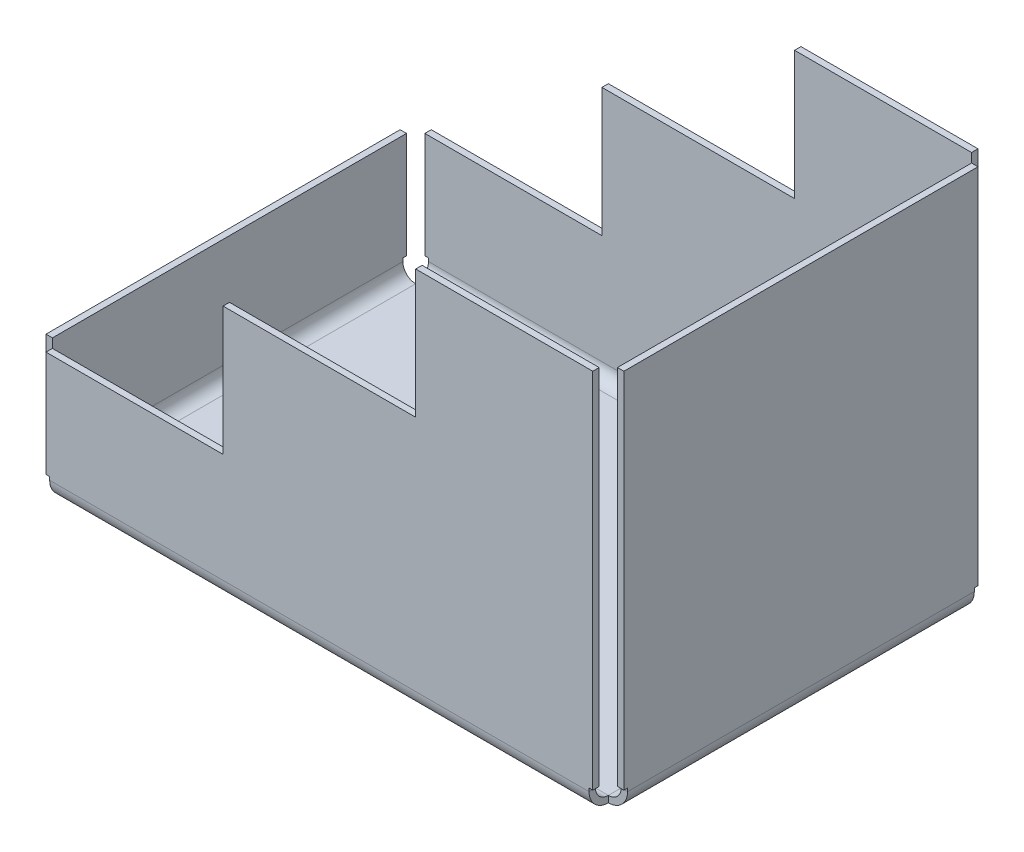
ISO-10303-21;
HEADER;
FILE_DESCRIPTION(('STEP AP214'),'2;1');
FILE_NAME('part.step','',(''),(''),'','','');
FILE_SCHEMA(('AUTOMOTIVE_DESIGN { 1 0 10303 214 1 1 1 1 }'));
ENDSEC;
DATA;
#1=APPLICATION_CONTEXT('core data for automotive mechanical design processes');
#2=APPLICATION_PROTOCOL_DEFINITION('international standard','automotive_design',2000,#1);
#3=PRODUCT_CONTEXT('',#1,'mechanical');
#4=PRODUCT('Part','Part','',(#3));
#5=PRODUCT_RELATED_PRODUCT_CATEGORY('part','',(#4));
#6=PRODUCT_DEFINITION_FORMATION('','',#4);
#7=PRODUCT_DEFINITION_CONTEXT('part definition',#1,'design');
#8=PRODUCT_DEFINITION('design','',#6,#7);
#9=PRODUCT_DEFINITION_SHAPE('','',#8);
#10=(LENGTH_UNIT() NAMED_UNIT(*) SI_UNIT(.MILLI.,.METRE.));
#11=(NAMED_UNIT(*) PLANE_ANGLE_UNIT() SI_UNIT($,.RADIAN.));
#12=(NAMED_UNIT(*) SI_UNIT($,.STERADIAN.) SOLID_ANGLE_UNIT());
#13=UNCERTAINTY_MEASURE_WITH_UNIT(LENGTH_MEASURE(1.E-05),#10,'distance_accuracy_value','');
#14=(GEOMETRIC_REPRESENTATION_CONTEXT(3) GLOBAL_UNCERTAINTY_ASSIGNED_CONTEXT((#13)) GLOBAL_UNIT_ASSIGNED_CONTEXT((#10,
#11,#12)) REPRESENTATION_CONTEXT('',''));
#15=CARTESIAN_POINT('',(0.,0.,0.));
#16=DIRECTION('',(0.,0.,1.));
#17=DIRECTION('',(1.,0.,0.));
#18=AXIS2_PLACEMENT_3D('',#15,#16,#17);
#19=CARTESIAN_POINT('',(-45.,-16.509701,30.));
#20=DIRECTION('',(0.,1.,0.));
#21=DIRECTION('',(0.,0.,1.));
#22=AXIS2_PLACEMENT_3D('',#19,#20,#21);
#23=PLANE('',#22);
#24=DIRECTION('',(-1.,0.,0.));
#25=VECTOR('',#24,1.);
#26=CARTESIAN_POINT('',(-45.,-16.509701,27.));
#27=LINE('',#26,#25);
#28=CARTESIAN_POINT('',(-44.,-16.509701,27.));
#29=VERTEX_POINT('',#28);
#30=CARTESIAN_POINT('',(-45.,-16.509701,27.));
#31=VERTEX_POINT('',#30);
#32=EDGE_CURVE('E11',#29,#31,#27,.T.);
#33=ORIENTED_EDGE('',*,*,#32,.F.);
#34=DIRECTION('',(0.,0.,1.));
#35=VECTOR('',#34,1.);
#36=CARTESIAN_POINT('',(-44.,-16.509701,30.));
#37=LINE('',#36,#35);
#38=CARTESIAN_POINT('',(-44.,-16.509701,27.5757864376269));
#39=VERTEX_POINT('',#38);
#40=EDGE_CURVE('E191',#29,#39,#37,.T.);
#41=ORIENTED_EDGE('',*,*,#40,.T.);
#42=DIRECTION('',(-1.,0.,0.));
#43=VECTOR('',#42,1.);
#44=CARTESIAN_POINT('',(-45.,-16.509701,27.5757864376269));
#45=LINE('',#44,#43);
#46=CARTESIAN_POINT('',(-45.,-16.509701,27.5757864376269));
#47=VERTEX_POINT('',#46);
#48=EDGE_CURVE('E44',#39,#47,#45,.T.);
#49=ORIENTED_EDGE('',*,*,#48,.T.);
#50=DIRECTION('',(0.,0.,1.));
#51=VECTOR('',#50,1.);
#52=CARTESIAN_POINT('',(-45.,-16.509701,30.));
#53=LINE('',#52,#51);
#54=EDGE_CURVE('E194',#31,#47,#53,.T.);
#55=ORIENTED_EDGE('',*,*,#54,.F.);
#56=EDGE_LOOP('',(#33,#41,#49,#55));
#57=FACE_BOUND('',#56,.T.);
#58=ADVANCED_FACE('F34',(#57),#23,.F.);
#59=CARTESIAN_POINT('',(-45.,2.,27.5757864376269));
#60=DIRECTION('',(0.,0.,1.));
#61=DIRECTION('',(0.,-1.,0.));
#62=AXIS2_PLACEMENT_3D('',#59,#60,#61);
#63=PLANE('',#62);
#64=ORIENTED_EDGE('',*,*,#48,.F.);
#65=DIRECTION('',(0.,1.,0.));
#66=VECTOR('',#65,1.);
#67=CARTESIAN_POINT('',(-44.,-20.,27.5757864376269));
#68=LINE('',#67,#66);
#69=CARTESIAN_POINT('',(-44.,0.,27.5757864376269));
#70=VERTEX_POINT('',#69);
#71=EDGE_CURVE('E209',#39,#70,#68,.T.);
#72=ORIENTED_EDGE('',*,*,#71,.T.);
#73=DIRECTION('',(-1.,0.,0.));
#74=VECTOR('',#73,1.);
#75=CARTESIAN_POINT('',(-45.,0.,27.5757864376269));
#76=LINE('',#75,#74);
#77=CARTESIAN_POINT('',(-45.,0.,27.5757864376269));
#78=VERTEX_POINT('',#77);
#79=EDGE_CURVE('E339',#70,#78,#76,.T.);
#80=ORIENTED_EDGE('',*,*,#79,.T.);
#81=DIRECTION('',(0.,-1.,0.));
#82=VECTOR('',#81,1.);
#83=CARTESIAN_POINT('',(-45.,2.,27.5757864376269));
#84=LINE('',#83,#82);
#85=EDGE_CURVE('E353',#47,#78,#84,.F.);
#86=ORIENTED_EDGE('',*,*,#85,.F.);
#87=EDGE_LOOP('',(#64,#72,#80,#86));
#88=FACE_BOUND('',#87,.T.);
#89=ADVANCED_FACE('F359',(#88),#63,.T.);
#90=CARTESIAN_POINT('',(-45.,0.,30.));
#91=DIRECTION('',(0.,-1.,0.));
#92=DIRECTION('',(0.,0.,-1.));
#93=AXIS2_PLACEMENT_3D('',#90,#91,#92);
#94=PLANE('',#93);
#95=ORIENTED_EDGE('',*,*,#79,.F.);
#96=DIRECTION('',(0.,0.,1.));
#97=VECTOR('',#96,1.);
#98=CARTESIAN_POINT('',(-44.,0.,30.));
#99=LINE('',#98,#97);
#100=CARTESIAN_POINT('',(-44.,0.,-27.5757864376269));
#101=VERTEX_POINT('',#100);
#102=EDGE_CURVE('E501',#70,#101,#99,.F.);
#103=ORIENTED_EDGE('',*,*,#102,.T.);
#104=DIRECTION('',(-1.,0.,0.));
#105=VECTOR('',#104,1.);
#106=CARTESIAN_POINT('',(-45.,0.,-27.5757864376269));
#107=LINE('',#106,#105);
#108=CARTESIAN_POINT('',(-45.,0.,-27.5757864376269));
#109=VERTEX_POINT('',#108);
#110=EDGE_CURVE('E336',#101,#109,#107,.T.);
#111=ORIENTED_EDGE('',*,*,#110,.T.);
#112=DIRECTION('',(0.,0.,-1.));
#113=VECTOR('',#112,1.);
#114=CARTESIAN_POINT('',(-45.,0.,30.));
#115=LINE('',#114,#113);
#116=EDGE_CURVE('E642',#78,#109,#115,.T.);
#117=ORIENTED_EDGE('',*,*,#116,.F.);
#118=EDGE_LOOP('',(#95,#103,#111,#117));
#119=FACE_BOUND('',#118,.T.);
#120=ADVANCED_FACE('F595',(#119),#94,.F.);
#121=CARTESIAN_POINT('',(-45.,2.,-27.5757864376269));
#122=DIRECTION('',(0.,0.,1.));
#123=DIRECTION('',(0.,-1.,0.));
#124=AXIS2_PLACEMENT_3D('',#121,#122,#123);
#125=PLANE('',#124);
#126=ORIENTED_EDGE('',*,*,#110,.F.);
#127=DIRECTION('',(0.,1.,0.));
#128=VECTOR('',#127,1.);
#129=CARTESIAN_POINT('',(-44.,-20.,-27.5757864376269));
#130=LINE('',#129,#128);
#131=CARTESIAN_POINT('',(-44.,-16.509701,-27.5757864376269));
#132=VERTEX_POINT('',#131);
#133=EDGE_CURVE('E535',#101,#132,#130,.F.);
#134=ORIENTED_EDGE('',*,*,#133,.T.);
#135=DIRECTION('',(-1.,0.,0.));
#136=VECTOR('',#135,1.);
#137=CARTESIAN_POINT('',(-45.,-16.509701,-27.5757864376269));
#138=LINE('',#137,#136);
#139=CARTESIAN_POINT('',(-45.,-16.509701,-27.5757864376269));
#140=VERTEX_POINT('',#139);
#141=EDGE_CURVE('E333',#132,#140,#138,.T.);
#142=ORIENTED_EDGE('',*,*,#141,.T.);
#143=DIRECTION('',(0.,-1.,0.));
#144=VECTOR('',#143,1.);
#145=CARTESIAN_POINT('',(-45.,2.,-27.5757864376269));
#146=LINE('',#145,#144);
#147=EDGE_CURVE('E604',#109,#140,#146,.T.);
#148=ORIENTED_EDGE('',*,*,#147,.F.);
#149=EDGE_LOOP('',(#126,#134,#142,#148));
#150=FACE_BOUND('',#149,.T.);
#151=ADVANCED_FACE('F600',(#150),#125,.F.);
#152=CARTESIAN_POINT('',(-45.,-16.509701,30.));
#153=DIRECTION('',(0.,1.,0.));
#154=DIRECTION('',(0.,0.,1.));
#155=AXIS2_PLACEMENT_3D('',#152,#153,#154);
#156=PLANE('',#155);
#157=ORIENTED_EDGE('',*,*,#141,.F.);
#158=DIRECTION('',(0.,0.,1.));
#159=VECTOR('',#158,1.);
#160=CARTESIAN_POINT('',(-44.,-16.509701,30.));
#161=LINE('',#160,#159);
#162=CARTESIAN_POINT('',(-44.,-16.509701,-27.));
#163=VERTEX_POINT('',#162);
#164=EDGE_CURVE('E550',#132,#163,#161,.T.);
#165=ORIENTED_EDGE('',*,*,#164,.T.);
#166=DIRECTION('',(-1.,0.,0.));
#167=VECTOR('',#166,1.);
#168=CARTESIAN_POINT('',(-45.,-16.509701,-27.));
#169=LINE('',#168,#167);
#170=CARTESIAN_POINT('',(-45.,-16.509701,-27.));
#171=VERTEX_POINT('',#170);
#172=EDGE_CURVE('E330',#163,#171,#169,.T.);
#173=ORIENTED_EDGE('',*,*,#172,.T.);
#174=DIRECTION('',(0.,0.,1.));
#175=VECTOR('',#174,1.);
#176=CARTESIAN_POINT('',(-45.,-16.509701,30.));
#177=LINE('',#176,#175);
#178=EDGE_CURVE('E394',#140,#171,#177,.T.);
#179=ORIENTED_EDGE('',*,*,#178,.F.);
#180=EDGE_LOOP('',(#157,#165,#173,#179));
#181=FACE_BOUND('',#180,.T.);
#182=ADVANCED_FACE('F729',(#181),#156,.F.);
#183=CARTESIAN_POINT('',(-45.,-20.,-27.));
#184=DIRECTION('',(0.,0.,-1.));
#185=DIRECTION('',(0.,1.,0.));
#186=AXIS2_PLACEMENT_3D('',#183,#184,#185);
#187=PLANE('',#186);
#188=ORIENTED_EDGE('',*,*,#172,.F.);
#189=DIRECTION('',(0.,1.,0.));
#190=VECTOR('',#189,1.);
#191=CARTESIAN_POINT('',(-44.,-20.,-27.));
#192=LINE('',#191,#190);
#193=CARTESIAN_POINT('',(-44.,-17.,-27.));
#194=VERTEX_POINT('',#193);
#195=EDGE_CURVE('E581',#194,#163,#192,.T.);
#196=ORIENTED_EDGE('',*,*,#195,.F.);
#197=DIRECTION('',(-1.,0.,0.));
#198=VECTOR('',#197,1.);
#199=CARTESIAN_POINT('',(-45.,-17.,-27.));
#200=LINE('',#199,#198);
#201=CARTESIAN_POINT('',(-45.,-17.,-27.));
#202=VERTEX_POINT('',#201);
#203=EDGE_CURVE('E327',#194,#202,#200,.T.);
#204=ORIENTED_EDGE('',*,*,#203,.T.);
#205=DIRECTION('',(0.,1.,0.));
#206=VECTOR('',#205,1.);
#207=CARTESIAN_POINT('',(-45.,-20.,-27.));
#208=LINE('',#207,#206);
#209=EDGE_CURVE('E399',#202,#171,#208,.T.);
#210=ORIENTED_EDGE('',*,*,#209,.T.);
#211=EDGE_LOOP('',(#188,#196,#204,#210));
#212=FACE_BOUND('',#211,.T.);
#213=ADVANCED_FACE('F732',(#212),#187,.T.);
#214=CARTESIAN_POINT('',(-42.,-17.,-27.));
#215=DIRECTION('',(0.,0.,1.));
#216=DIRECTION('',(1.,0.,0.));
#217=AXIS2_PLACEMENT_3D('',#214,#215,#216);
#218=PLANE('',#217);
#219=ORIENTED_EDGE('',*,*,#203,.F.);
#220=CARTESIAN_POINT('',(-42.,-17.,-27.));
#221=DIRECTION('',(0.,0.,-1.));
#222=DIRECTION('',(-1.,0.,0.));
#223=AXIS2_PLACEMENT_3D('',#220,#221,#222);
#224=CIRCLE('',#223,2.);
#225=CARTESIAN_POINT('',(-42.,-19.,-27.));
#226=VERTEX_POINT('',#225);
#227=EDGE_CURVE('E483',#194,#226,#224,.F.);
#228=ORIENTED_EDGE('',*,*,#227,.T.);
#229=DIRECTION('',(0.,-1.,0.));
#230=VECTOR('',#229,1.);
#231=CARTESIAN_POINT('',(-42.,-20.,-27.));
#232=LINE('',#231,#230);
#233=CARTESIAN_POINT('',(-42.,-20.,-27.));
#234=VERTEX_POINT('',#233);
#235=EDGE_CURVE('E324',#226,#234,#232,.T.);
#236=ORIENTED_EDGE('',*,*,#235,.T.);
#237=CARTESIAN_POINT('',(-42.,-17.,-27.));
#238=DIRECTION('',(0.,0.,-1.));
#239=DIRECTION('',(-1.,0.,0.));
#240=AXIS2_PLACEMENT_3D('',#237,#238,#239);
#241=CIRCLE('',#240,3.);
#242=EDGE_CURVE('E414',#202,#234,#241,.F.);
#243=ORIENTED_EDGE('',*,*,#242,.F.);
#244=EDGE_LOOP('',(#219,#228,#236,#243));
#245=FACE_BOUND('',#244,.T.);
#246=ADVANCED_FACE('F736',(#245),#218,.F.);
#247=CARTESIAN_POINT('',(-42.,-17.,-27.));
#248=DIRECTION('',(-1.,0.,0.));
#249=DIRECTION('',(0.,-1.,0.));
#250=AXIS2_PLACEMENT_3D('',#247,#248,#249);
#251=PLANE('',#250);
#252=ORIENTED_EDGE('',*,*,#235,.F.);
#253=CARTESIAN_POINT('',(-42.,-17.,-27.));
#254=DIRECTION('',(-1.,0.,0.));
#255=DIRECTION('',(0.,-1.,0.));
#256=AXIS2_PLACEMENT_3D('',#253,#254,#255);
#257=CIRCLE('',#256,2.);
#258=CARTESIAN_POINT('',(-42.,-17.,-29.));
#259=VERTEX_POINT('',#258);
#260=EDGE_CURVE('E553',#226,#259,#257,.F.);
#261=ORIENTED_EDGE('',*,*,#260,.T.);
#262=DIRECTION('',(0.,0.,-1.));
#263=VECTOR('',#262,1.);
#264=CARTESIAN_POINT('',(-42.,-17.,-30.));
#265=LINE('',#264,#263);
#266=CARTESIAN_POINT('',(-42.,-17.,-30.));
#267=VERTEX_POINT('',#266);
#268=EDGE_CURVE('E321',#259,#267,#265,.T.);
#269=ORIENTED_EDGE('',*,*,#268,.T.);
#270=CARTESIAN_POINT('',(-42.,-17.,-27.));
#271=DIRECTION('',(1.,0.,0.));
#272=DIRECTION('',(0.,1.,0.));
#273=AXIS2_PLACEMENT_3D('',#270,#271,#272);
#274=CIRCLE('',#273,3.);
#275=EDGE_CURVE('E431',#234,#267,#274,.T.);
#276=ORIENTED_EDGE('',*,*,#275,.F.);
#277=EDGE_LOOP('',(#252,#261,#269,#276));
#278=FACE_BOUND('',#277,.T.);
#279=ADVANCED_FACE('F740',(#278),#251,.T.);
#280=CARTESIAN_POINT('',(-42.,40.,-30.));
#281=DIRECTION('',(-1.,0.,0.));
#282=DIRECTION('',(0.,1.,0.));
#283=AXIS2_PLACEMENT_3D('',#280,#281,#282);
#284=PLANE('',#283);
#285=ORIENTED_EDGE('',*,*,#268,.F.);
#286=DIRECTION('',(0.,1.,0.));
#287=VECTOR('',#286,1.);
#288=CARTESIAN_POINT('',(-42.,40.,-29.));
#289=LINE('',#288,#287);
#290=CARTESIAN_POINT('',(-42.,-16.509701,-29.));
#291=VERTEX_POINT('',#290);
#292=EDGE_CURVE('E469',#259,#291,#289,.T.);
#293=ORIENTED_EDGE('',*,*,#292,.T.);
#294=DIRECTION('',(0.,0.,-1.));
#295=VECTOR('',#294,1.);
#296=CARTESIAN_POINT('',(-42.,-16.509701,-30.));
#297=LINE('',#296,#295);
#298=CARTESIAN_POINT('',(-42.,-16.509701,-30.));
#299=VERTEX_POINT('',#298);
#300=EDGE_CURVE('E318',#291,#299,#297,.T.);
#301=ORIENTED_EDGE('',*,*,#300,.T.);
#302=DIRECTION('',(0.,1.,0.));
#303=VECTOR('',#302,1.);
#304=CARTESIAN_POINT('',(-42.,40.,-30.));
#305=LINE('',#304,#303);
#306=EDGE_CURVE('E403',#267,#299,#305,.T.);
#307=ORIENTED_EDGE('',*,*,#306,.F.);
#308=EDGE_LOOP('',(#285,#293,#301,#307));
#309=FACE_BOUND('',#308,.T.);
#310=ADVANCED_FACE('F744',(#309),#284,.T.);
#311=CARTESIAN_POINT('',(45.,-16.509701,-30.));
#312=DIRECTION('',(0.,1.,0.));
#313=DIRECTION('',(1.,0.,0.));
#314=AXIS2_PLACEMENT_3D('',#311,#312,#313);
#315=PLANE('',#314);
#316=ORIENTED_EDGE('',*,*,#300,.F.);
#317=DIRECTION('',(-1.,0.,0.));
#318=VECTOR('',#317,1.);
#319=CARTESIAN_POINT('',(45.,-16.509701,-29.));
#320=LINE('',#319,#318);
#321=CARTESIAN_POINT('',(-42.5757864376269,-16.509701,-29.));
#322=VERTEX_POINT('',#321);
#323=EDGE_CURVE('E578',#322,#291,#320,.F.);
#324=ORIENTED_EDGE('',*,*,#323,.F.);
#325=DIRECTION('',(0.,0.,-1.));
#326=VECTOR('',#325,1.);
#327=CARTESIAN_POINT('',(-42.5757864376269,-16.509701,-30.));
#328=LINE('',#327,#326);
#329=CARTESIAN_POINT('',(-42.5757864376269,-16.509701,-30.));
#330=VERTEX_POINT('',#329);
#331=EDGE_CURVE('E315',#322,#330,#328,.T.);
#332=ORIENTED_EDGE('',*,*,#331,.T.);
#333=DIRECTION('',(1.,0.,0.));
#334=VECTOR('',#333,1.);
#335=CARTESIAN_POINT('',(45.,-16.509701,-30.));
#336=LINE('',#335,#334);
#337=EDGE_CURVE('E402',#330,#299,#336,.T.);
#338=ORIENTED_EDGE('',*,*,#337,.T.);
#339=EDGE_LOOP('',(#316,#324,#332,#338));
#340=FACE_BOUND('',#339,.T.);
#341=ADVANCED_FACE('F748',(#340),#315,.F.);
#342=CARTESIAN_POINT('',(-42.5757864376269,2.,-30.));
#343=DIRECTION('',(1.,0.,0.));
#344=DIRECTION('',(0.,-1.,0.));
#345=AXIS2_PLACEMENT_3D('',#342,#343,#344);
#346=PLANE('',#345);
#347=ORIENTED_EDGE('',*,*,#331,.F.);
#348=DIRECTION('',(0.,1.,0.));
#349=VECTOR('',#348,1.);
#350=CARTESIAN_POINT('',(-42.5757864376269,40.,-29.));
#351=LINE('',#350,#349);
#352=CARTESIAN_POINT('',(-42.5757864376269,0.,-29.));
#353=VERTEX_POINT('',#352);
#354=EDGE_CURVE('E497',#353,#322,#351,.F.);
#355=ORIENTED_EDGE('',*,*,#354,.F.);
#356=DIRECTION('',(0.,0.,-1.));
#357=VECTOR('',#356,1.);
#358=CARTESIAN_POINT('',(-42.5757864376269,0.,-30.));
#359=LINE('',#358,#357);
#360=CARTESIAN_POINT('',(-42.5757864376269,0.,-30.));
#361=VERTEX_POINT('',#360);
#362=EDGE_CURVE('E312',#353,#361,#359,.T.);
#363=ORIENTED_EDGE('',*,*,#362,.T.);
#364=DIRECTION('',(0.,-1.,0.));
#365=VECTOR('',#364,1.);
#366=CARTESIAN_POINT('',(-42.5757864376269,2.,-30.));
#367=LINE('',#366,#365);
#368=EDGE_CURVE('E366',#361,#330,#367,.T.);
#369=ORIENTED_EDGE('',*,*,#368,.T.);
#370=EDGE_LOOP('',(#347,#355,#363,#369));
#371=FACE_BOUND('',#370,.T.);
#372=ADVANCED_FACE('F752',(#371),#346,.F.);
#373=CARTESIAN_POINT('',(-45.,0.,-30.));
#374=DIRECTION('',(0.,-1.,0.));
#375=DIRECTION('',(-1.,0.,0.));
#376=AXIS2_PLACEMENT_3D('',#373,#374,#375);
#377=PLANE('',#376);
#378=ORIENTED_EDGE('',*,*,#362,.F.);
#379=DIRECTION('',(-1.,0.,0.));
#380=VECTOR('',#379,1.);
#381=CARTESIAN_POINT('',(45.,0.,-29.));
#382=LINE('',#381,#380);
#383=CARTESIAN_POINT('',(-15.,0.,-29.));
#384=VERTEX_POINT('',#383);
#385=EDGE_CURVE('E565',#384,#353,#382,.T.);
#386=ORIENTED_EDGE('',*,*,#385,.F.);
#387=DIRECTION('',(0.,0.,-1.));
#388=VECTOR('',#387,1.);
#389=CARTESIAN_POINT('',(-15.,0.,-30.));
#390=LINE('',#389,#388);
#391=CARTESIAN_POINT('',(-15.,0.,-30.));
#392=VERTEX_POINT('',#391);
#393=EDGE_CURVE('E309',#384,#392,#390,.T.);
#394=ORIENTED_EDGE('',*,*,#393,.T.);
#395=DIRECTION('',(-1.,0.,0.));
#396=VECTOR('',#395,1.);
#397=CARTESIAN_POINT('',(-45.,0.,-30.));
#398=LINE('',#397,#396);
#399=EDGE_CURVE('E636',#392,#361,#398,.T.);
#400=ORIENTED_EDGE('',*,*,#399,.T.);
#401=EDGE_LOOP('',(#378,#386,#394,#400));
#402=FACE_BOUND('',#401,.T.);
#403=ADVANCED_FACE('F756',(#402),#377,.F.);
#404=CARTESIAN_POINT('',(-15.,0.,-30.));
#405=DIRECTION('',(1.,0.,0.));
#406=DIRECTION('',(0.,-1.,0.));
#407=AXIS2_PLACEMENT_3D('',#404,#405,#406);
#408=PLANE('',#407);
#409=ORIENTED_EDGE('',*,*,#393,.F.);
#410=DIRECTION('',(0.,1.,0.));
#411=VECTOR('',#410,1.);
#412=CARTESIAN_POINT('',(-15.,40.,-29.));
#413=LINE('',#412,#411);
#414=CARTESIAN_POINT('',(-15.,20.,-29.));
#415=VERTEX_POINT('',#414);
#416=EDGE_CURVE('E571',#415,#384,#413,.F.);
#417=ORIENTED_EDGE('',*,*,#416,.F.);
#418=DIRECTION('',(0.,0.,-1.));
#419=VECTOR('',#418,1.);
#420=CARTESIAN_POINT('',(-15.,20.,-30.));
#421=LINE('',#420,#419);
#422=CARTESIAN_POINT('',(-15.,20.,-30.));
#423=VERTEX_POINT('',#422);
#424=EDGE_CURVE('E306',#415,#423,#421,.T.);
#425=ORIENTED_EDGE('',*,*,#424,.T.);
#426=DIRECTION('',(0.,-1.,0.));
#427=VECTOR('',#426,1.);
#428=CARTESIAN_POINT('',(-15.,0.,-30.));
#429=LINE('',#428,#427);
#430=EDGE_CURVE('E633',#423,#392,#429,.T.);
#431=ORIENTED_EDGE('',*,*,#430,.T.);
#432=EDGE_LOOP('',(#409,#417,#425,#431));
#433=FACE_BOUND('',#432,.T.);
#434=ADVANCED_FACE('F760',(#433),#408,.F.);
#435=CARTESIAN_POINT('',(-15.,20.,-30.));
#436=DIRECTION('',(0.,-1.,0.));
#437=DIRECTION('',(-1.,0.,0.));
#438=AXIS2_PLACEMENT_3D('',#435,#436,#437);
#439=PLANE('',#438);
#440=ORIENTED_EDGE('',*,*,#424,.F.);
#441=DIRECTION('',(-1.,0.,0.));
#442=VECTOR('',#441,1.);
#443=CARTESIAN_POINT('',(45.,20.,-29.));
#444=LINE('',#443,#442);
#445=CARTESIAN_POINT('',(15.,20.,-29.));
#446=VERTEX_POINT('',#445);
#447=EDGE_CURVE('E568',#446,#415,#444,.T.);
#448=ORIENTED_EDGE('',*,*,#447,.F.);
#449=DIRECTION('',(0.,0.,-1.));
#450=VECTOR('',#449,1.);
#451=CARTESIAN_POINT('',(15.,20.,-30.));
#452=LINE('',#451,#450);
#453=CARTESIAN_POINT('',(15.,20.,-30.));
#454=VERTEX_POINT('',#453);
#455=EDGE_CURVE('E303',#446,#454,#452,.T.);
#456=ORIENTED_EDGE('',*,*,#455,.T.);
#457=DIRECTION('',(-1.,0.,0.));
#458=VECTOR('',#457,1.);
#459=CARTESIAN_POINT('',(-15.,20.,-30.));
#460=LINE('',#459,#458);
#461=EDGE_CURVE('E630',#454,#423,#460,.T.);
#462=ORIENTED_EDGE('',*,*,#461,.T.);
#463=EDGE_LOOP('',(#440,#448,#456,#462));
#464=FACE_BOUND('',#463,.T.);
#465=ADVANCED_FACE('F764',(#464),#439,.F.);
#466=CARTESIAN_POINT('',(15.,20.,-30.));
#467=DIRECTION('',(1.,0.,0.));
#468=DIRECTION('',(0.,-1.,0.));
#469=AXIS2_PLACEMENT_3D('',#466,#467,#468);
#470=PLANE('',#469);
#471=ORIENTED_EDGE('',*,*,#455,.F.);
#472=DIRECTION('',(0.,1.,0.));
#473=VECTOR('',#472,1.);
#474=CARTESIAN_POINT('',(15.,40.,-29.));
#475=LINE('',#474,#473);
#476=CARTESIAN_POINT('',(15.,40.,-29.));
#477=VERTEX_POINT('',#476);
#478=EDGE_CURVE('E540',#477,#446,#475,.F.);
#479=ORIENTED_EDGE('',*,*,#478,.F.);
#480=DIRECTION('',(0.,0.,-1.));
#481=VECTOR('',#480,1.);
#482=CARTESIAN_POINT('',(15.,40.,-30.));
#483=LINE('',#482,#481);
#484=CARTESIAN_POINT('',(15.,40.,-30.));
#485=VERTEX_POINT('',#484);
#486=EDGE_CURVE('E300',#477,#485,#483,.T.);
#487=ORIENTED_EDGE('',*,*,#486,.T.);
#488=DIRECTION('',(0.,-1.,0.));
#489=VECTOR('',#488,1.);
#490=CARTESIAN_POINT('',(15.,20.,-30.));
#491=LINE('',#490,#489);
#492=EDGE_CURVE('E627',#485,#454,#491,.T.);
#493=ORIENTED_EDGE('',*,*,#492,.T.);
#494=EDGE_LOOP('',(#471,#479,#487,#493));
#495=FACE_BOUND('',#494,.T.);
#496=ADVANCED_FACE('F768',(#495),#470,.F.);
#497=CARTESIAN_POINT('',(15.,40.,-30.));
#498=DIRECTION('',(0.,-1.,0.));
#499=DIRECTION('',(-1.,0.,0.));
#500=AXIS2_PLACEMENT_3D('',#497,#498,#499);
#501=PLANE('',#500);
#502=ORIENTED_EDGE('',*,*,#486,.F.);
#503=DIRECTION('',(-1.,0.,0.));
#504=VECTOR('',#503,1.);
#505=CARTESIAN_POINT('',(45.,40.,-29.));
#506=LINE('',#505,#504);
#507=CARTESIAN_POINT('',(42.5757864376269,40.,-29.));
#508=VERTEX_POINT('',#507);
#509=EDGE_CURVE('E562',#508,#477,#506,.T.);
#510=ORIENTED_EDGE('',*,*,#509,.F.);
#511=DIRECTION('',(0.,0.,-1.));
#512=VECTOR('',#511,1.);
#513=CARTESIAN_POINT('',(42.5757864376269,40.,-30.));
#514=LINE('',#513,#512);
#515=CARTESIAN_POINT('',(42.5757864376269,40.,-30.));
#516=VERTEX_POINT('',#515);
#517=EDGE_CURVE('E297',#508,#516,#514,.T.);
#518=ORIENTED_EDGE('',*,*,#517,.T.);
#519=DIRECTION('',(-1.,0.,0.));
#520=VECTOR('',#519,1.);
#521=CARTESIAN_POINT('',(15.,40.,-30.));
#522=LINE('',#521,#520);
#523=EDGE_CURVE('E639',#516,#485,#522,.T.);
#524=ORIENTED_EDGE('',*,*,#523,.T.);
#525=EDGE_LOOP('',(#502,#510,#518,#524));
#526=FACE_BOUND('',#525,.T.);
#527=ADVANCED_FACE('F772',(#526),#501,.F.);
#528=CARTESIAN_POINT('',(42.5757864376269,-22.,-30.));
#529=DIRECTION('',(-1.,0.,0.));
#530=DIRECTION('',(0.,1.,0.));
#531=AXIS2_PLACEMENT_3D('',#528,#529,#530);
#532=PLANE('',#531);
#533=ORIENTED_EDGE('',*,*,#517,.F.);
#534=DIRECTION('',(0.,1.,0.));
#535=VECTOR('',#534,1.);
#536=CARTESIAN_POINT('',(42.5757864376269,40.,-29.));
#537=LINE('',#536,#535);
#538=CARTESIAN_POINT('',(42.5757864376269,-16.509701,-29.));
#539=VERTEX_POINT('',#538);
#540=EDGE_CURVE('E539',#539,#508,#537,.T.);
#541=ORIENTED_EDGE('',*,*,#540,.F.);
#542=DIRECTION('',(0.,0.,-1.));
#543=VECTOR('',#542,1.);
#544=CARTESIAN_POINT('',(42.5757864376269,-16.509701,-30.));
#545=LINE('',#544,#543);
#546=CARTESIAN_POINT('',(42.5757864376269,-16.509701,-30.));
#547=VERTEX_POINT('',#546);
#548=EDGE_CURVE('E294',#539,#547,#545,.T.);
#549=ORIENTED_EDGE('',*,*,#548,.T.);
#550=DIRECTION('',(0.,1.,0.));
#551=VECTOR('',#550,1.);
#552=CARTESIAN_POINT('',(42.5757864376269,-22.,-30.));
#553=LINE('',#552,#551);
#554=EDGE_CURVE('E621',#547,#516,#553,.T.);
#555=ORIENTED_EDGE('',*,*,#554,.T.);
#556=EDGE_LOOP('',(#533,#541,#549,#555));
#557=FACE_BOUND('',#556,.T.);
#558=ADVANCED_FACE('F776',(#557),#532,.F.);
#559=CARTESIAN_POINT('',(45.,-16.509701,-30.));
#560=DIRECTION('',(0.,1.,0.));
#561=DIRECTION('',(1.,0.,0.));
#562=AXIS2_PLACEMENT_3D('',#559,#560,#561);
#563=PLANE('',#562);
#564=ORIENTED_EDGE('',*,*,#548,.F.);
#565=DIRECTION('',(-1.,0.,0.));
#566=VECTOR('',#565,1.);
#567=CARTESIAN_POINT('',(45.,-16.509701,-29.));
#568=LINE('',#567,#566);
#569=CARTESIAN_POINT('',(42.,-16.509701,-29.));
#570=VERTEX_POINT('',#569);
#571=EDGE_CURVE('E524',#570,#539,#568,.F.);
#572=ORIENTED_EDGE('',*,*,#571,.F.);
#573=DIRECTION('',(0.,0.,-1.));
#574=VECTOR('',#573,1.);
#575=CARTESIAN_POINT('',(42.,-16.509701,-30.));
#576=LINE('',#575,#574);
#577=CARTESIAN_POINT('',(42.,-16.509701,-30.));
#578=VERTEX_POINT('',#577);
#579=EDGE_CURVE('E291',#570,#578,#576,.T.);
#580=ORIENTED_EDGE('',*,*,#579,.T.);
#581=DIRECTION('',(1.,0.,0.));
#582=VECTOR('',#581,1.);
#583=CARTESIAN_POINT('',(45.,-16.509701,-30.));
#584=LINE('',#583,#582);
#585=EDGE_CURVE('E382',#578,#547,#584,.T.);
#586=ORIENTED_EDGE('',*,*,#585,.T.);
#587=EDGE_LOOP('',(#564,#572,#580,#586));
#588=FACE_BOUND('',#587,.T.);
#589=ADVANCED_FACE('F780',(#588),#563,.F.);
#590=CARTESIAN_POINT('',(42.,40.,-30.));
#591=DIRECTION('',(1.,0.,0.));
#592=DIRECTION('',(0.,-1.,0.));
#593=AXIS2_PLACEMENT_3D('',#590,#591,#592);
#594=PLANE('',#593);
#595=ORIENTED_EDGE('',*,*,#579,.F.);
#596=DIRECTION('',(0.,1.,0.));
#597=VECTOR('',#596,1.);
#598=CARTESIAN_POINT('',(42.,40.,-29.));
#599=LINE('',#598,#597);
#600=CARTESIAN_POINT('',(42.,-17.,-29.));
#601=VERTEX_POINT('',#600);
#602=EDGE_CURVE('E547',#570,#601,#599,.F.);
#603=ORIENTED_EDGE('',*,*,#602,.T.);
#604=DIRECTION('',(0.,0.,-1.));
#605=VECTOR('',#604,1.);
#606=CARTESIAN_POINT('',(42.,-17.,-30.));
#607=LINE('',#606,#605);
#608=CARTESIAN_POINT('',(42.,-17.,-30.));
#609=VERTEX_POINT('',#608);
#610=EDGE_CURVE('E288',#601,#609,#607,.T.);
#611=ORIENTED_EDGE('',*,*,#610,.T.);
#612=DIRECTION('',(0.,-1.,0.));
#613=VECTOR('',#612,1.);
#614=CARTESIAN_POINT('',(42.,40.,-30.));
#615=LINE('',#614,#613);
#616=EDGE_CURVE('E387',#578,#609,#615,.T.);
#617=ORIENTED_EDGE('',*,*,#616,.F.);
#618=EDGE_LOOP('',(#595,#603,#611,#617));
#619=FACE_BOUND('',#618,.T.);
#620=ADVANCED_FACE('F784',(#619),#594,.T.);
#621=CARTESIAN_POINT('',(42.,-17.,-27.));
#622=DIRECTION('',(1.,0.,0.));
#623=DIRECTION('',(0.,1.,0.));
#624=AXIS2_PLACEMENT_3D('',#621,#622,#623);
#625=PLANE('',#624);
#626=ORIENTED_EDGE('',*,*,#610,.F.);
#627=CARTESIAN_POINT('',(42.,-17.,-27.));
#628=DIRECTION('',(-1.,0.,0.));
#629=DIRECTION('',(0.,-1.,0.));
#630=AXIS2_PLACEMENT_3D('',#627,#628,#629);
#631=CIRCLE('',#630,2.);
#632=CARTESIAN_POINT('',(42.,-19.,-27.));
#633=VERTEX_POINT('',#632);
#634=EDGE_CURVE('E487',#601,#633,#631,.T.);
#635=ORIENTED_EDGE('',*,*,#634,.T.);
#636=DIRECTION('',(0.,-1.,0.));
#637=VECTOR('',#636,1.);
#638=CARTESIAN_POINT('',(42.,-20.,-27.));
#639=LINE('',#638,#637);
#640=CARTESIAN_POINT('',(42.,-20.,-27.));
#641=VERTEX_POINT('',#640);
#642=EDGE_CURVE('E285',#633,#641,#639,.T.);
#643=ORIENTED_EDGE('',*,*,#642,.T.);
#644=CARTESIAN_POINT('',(42.,-17.,-27.));
#645=DIRECTION('',(-1.,0.,0.));
#646=DIRECTION('',(0.,-1.,0.));
#647=AXIS2_PLACEMENT_3D('',#644,#645,#646);
#648=CIRCLE('',#647,3.);
#649=EDGE_CURVE('E440',#609,#641,#648,.T.);
#650=ORIENTED_EDGE('',*,*,#649,.F.);
#651=EDGE_LOOP('',(#626,#635,#643,#650));
#652=FACE_BOUND('',#651,.T.);
#653=ADVANCED_FACE('F788',(#652),#625,.T.);
#654=CARTESIAN_POINT('',(42.,-17.,-27.));
#655=DIRECTION('',(0.,0.,1.));
#656=DIRECTION('',(1.,0.,0.));
#657=AXIS2_PLACEMENT_3D('',#654,#655,#656);
#658=PLANE('',#657);
#659=ORIENTED_EDGE('',*,*,#642,.F.);
#660=CARTESIAN_POINT('',(42.,-17.,-27.));
#661=DIRECTION('',(0.,0.,-1.));
#662=DIRECTION('',(-1.,0.,0.));
#663=AXIS2_PLACEMENT_3D('',#660,#661,#662);
#664=CIRCLE('',#663,2.);
#665=CARTESIAN_POINT('',(44.,-17.,-27.));
#666=VERTEX_POINT('',#665);
#667=EDGE_CURVE('E530',#633,#666,#664,.F.);
#668=ORIENTED_EDGE('',*,*,#667,.T.);
#669=DIRECTION('',(1.,0.,0.));
#670=VECTOR('',#669,1.);
#671=CARTESIAN_POINT('',(45.,-17.,-27.));
#672=LINE('',#671,#670);
#673=CARTESIAN_POINT('',(45.,-17.,-27.));
#674=VERTEX_POINT('',#673);
#675=EDGE_CURVE('E282',#666,#674,#672,.T.);
#676=ORIENTED_EDGE('',*,*,#675,.T.);
#677=CARTESIAN_POINT('',(42.,-17.,-27.));
#678=DIRECTION('',(0.,0.,-1.));
#679=DIRECTION('',(-1.,0.,0.));
#680=AXIS2_PLACEMENT_3D('',#677,#678,#679);
#681=CIRCLE('',#680,3.);
#682=EDGE_CURVE('E428',#641,#674,#681,.F.);
#683=ORIENTED_EDGE('',*,*,#682,.F.);
#684=EDGE_LOOP('',(#659,#668,#676,#683));
#685=FACE_BOUND('',#684,.T.);
#686=ADVANCED_FACE('F792',(#685),#658,.F.);
#687=CARTESIAN_POINT('',(45.,40.,-27.));
#688=DIRECTION('',(0.,0.,-1.));
#689=DIRECTION('',(0.,-1.,0.));
#690=AXIS2_PLACEMENT_3D('',#687,#688,#689);
#691=PLANE('',#690);
#692=ORIENTED_EDGE('',*,*,#675,.F.);
#693=DIRECTION('',(0.,-1.,0.));
#694=VECTOR('',#693,1.);
#695=CARTESIAN_POINT('',(44.,40.,-27.));
#696=LINE('',#695,#694);
#697=CARTESIAN_POINT('',(44.,-16.509701,-27.));
#698=VERTEX_POINT('',#697);
#699=EDGE_CURVE('E546',#698,#666,#696,.T.);
#700=ORIENTED_EDGE('',*,*,#699,.F.);
#701=DIRECTION('',(1.,0.,0.));
#702=VECTOR('',#701,1.);
#703=CARTESIAN_POINT('',(45.,-16.509701,-27.));
#704=LINE('',#703,#702);
#705=CARTESIAN_POINT('',(45.,-16.509701,-27.));
#706=VERTEX_POINT('',#705);
#707=EDGE_CURVE('E279',#698,#706,#704,.T.);
#708=ORIENTED_EDGE('',*,*,#707,.T.);
#709=DIRECTION('',(0.,-1.,0.));
#710=VECTOR('',#709,1.);
#711=CARTESIAN_POINT('',(45.,40.,-27.));
#712=LINE('',#711,#710);
#713=EDGE_CURVE('E391',#706,#674,#712,.T.);
#714=ORIENTED_EDGE('',*,*,#713,.T.);
#715=EDGE_LOOP('',(#692,#700,#708,#714));
#716=FACE_BOUND('',#715,.T.);
#717=ADVANCED_FACE('F796',(#716),#691,.T.);
#718=CARTESIAN_POINT('',(45.,-16.509701,30.));
#719=DIRECTION('',(0.,1.,0.));
#720=DIRECTION('',(0.,0.,-1.));
#721=AXIS2_PLACEMENT_3D('',#718,#719,#720);
#722=PLANE('',#721);
#723=ORIENTED_EDGE('',*,*,#707,.F.);
#724=DIRECTION('',(0.,0.,1.));
#725=VECTOR('',#724,1.);
#726=CARTESIAN_POINT('',(44.,-16.509701,30.));
#727=LINE('',#726,#725);
#728=CARTESIAN_POINT('',(44.,-16.509701,-27.5757864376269));
#729=VERTEX_POINT('',#728);
#730=EDGE_CURVE('E543',#698,#729,#727,.F.);
#731=ORIENTED_EDGE('',*,*,#730,.T.);
#732=DIRECTION('',(1.,0.,0.));
#733=VECTOR('',#732,1.);
#734=CARTESIAN_POINT('',(45.,-16.509701,-27.5757864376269));
#735=LINE('',#734,#733);
#736=CARTESIAN_POINT('',(45.,-16.509701,-27.5757864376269));
#737=VERTEX_POINT('',#736);
#738=EDGE_CURVE('E276',#729,#737,#735,.T.);
#739=ORIENTED_EDGE('',*,*,#738,.T.);
#740=DIRECTION('',(0.,0.,-1.));
#741=VECTOR('',#740,1.);
#742=CARTESIAN_POINT('',(45.,-16.509701,30.));
#743=LINE('',#742,#741);
#744=EDGE_CURVE('E390',#706,#737,#743,.T.);
#745=ORIENTED_EDGE('',*,*,#744,.F.);
#746=EDGE_LOOP('',(#723,#731,#739,#745));
#747=FACE_BOUND('',#746,.T.);
#748=ADVANCED_FACE('F800',(#747),#722,.F.);
#749=CARTESIAN_POINT('',(45.,-22.,-27.5757864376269));
#750=DIRECTION('',(0.,0.,1.));
#751=DIRECTION('',(0.,1.,0.));
#752=AXIS2_PLACEMENT_3D('',#749,#750,#751);
#753=PLANE('',#752);
#754=ORIENTED_EDGE('',*,*,#738,.F.);
#755=DIRECTION('',(0.,-1.,0.));
#756=VECTOR('',#755,1.);
#757=CARTESIAN_POINT('',(44.,40.,-27.5757864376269));
#758=LINE('',#757,#756);
#759=CARTESIAN_POINT('',(44.,40.,-27.5757864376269));
#760=VERTEX_POINT('',#759);
#761=EDGE_CURVE('E517',#729,#760,#758,.F.);
#762=ORIENTED_EDGE('',*,*,#761,.T.);
#763=DIRECTION('',(1.,0.,0.));
#764=VECTOR('',#763,1.);
#765=CARTESIAN_POINT('',(45.,40.,-27.5757864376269));
#766=LINE('',#765,#764);
#767=CARTESIAN_POINT('',(45.,40.,-27.5757864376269));
#768=VERTEX_POINT('',#767);
#769=EDGE_CURVE('E273',#760,#768,#766,.T.);
#770=ORIENTED_EDGE('',*,*,#769,.T.);
#771=DIRECTION('',(0.,1.,0.));
#772=VECTOR('',#771,1.);
#773=CARTESIAN_POINT('',(45.,-22.,-27.5757864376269));
#774=LINE('',#773,#772);
#775=EDGE_CURVE('E618',#737,#768,#774,.T.);
#776=ORIENTED_EDGE('',*,*,#775,.F.);
#777=EDGE_LOOP('',(#754,#762,#770,#776));
#778=FACE_BOUND('',#777,.T.);
#779=ADVANCED_FACE('F804',(#778),#753,.F.);
#780=CARTESIAN_POINT('',(45.,40.,30.));
#781=DIRECTION('',(0.,1.,0.));
#782=DIRECTION('',(0.,0.,-1.));
#783=AXIS2_PLACEMENT_3D('',#780,#781,#782);
#784=PLANE('',#783);
#785=ORIENTED_EDGE('',*,*,#769,.F.);
#786=DIRECTION('',(0.,0.,1.));
#787=VECTOR('',#786,1.);
#788=CARTESIAN_POINT('',(44.,40.,30.));
#789=LINE('',#788,#787);
#790=CARTESIAN_POINT('',(44.,40.,27.5757864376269));
#791=VERTEX_POINT('',#790);
#792=EDGE_CURVE('E536',#791,#760,#789,.F.);
#793=ORIENTED_EDGE('',*,*,#792,.F.);
#794=DIRECTION('',(1.,0.,0.));
#795=VECTOR('',#794,1.);
#796=CARTESIAN_POINT('',(45.,40.,27.5757864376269));
#797=LINE('',#796,#795);
#798=CARTESIAN_POINT('',(45.,40.,27.5757864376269));
#799=VERTEX_POINT('',#798);
#800=EDGE_CURVE('E270',#791,#799,#797,.T.);
#801=ORIENTED_EDGE('',*,*,#800,.T.);
#802=DIRECTION('',(0.,0.,-1.));
#803=VECTOR('',#802,1.);
#804=CARTESIAN_POINT('',(45.,40.,30.));
#805=LINE('',#804,#803);
#806=EDGE_CURVE('E624',#799,#768,#805,.T.);
#807=ORIENTED_EDGE('',*,*,#806,.T.);
#808=EDGE_LOOP('',(#785,#793,#801,#807));
#809=FACE_BOUND('',#808,.T.);
#810=ADVANCED_FACE('F808',(#809),#784,.T.);
#811=CARTESIAN_POINT('',(45.,-22.,27.5757864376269));
#812=DIRECTION('',(0.,0.,1.));
#813=DIRECTION('',(0.,1.,0.));
#814=AXIS2_PLACEMENT_3D('',#811,#812,#813);
#815=PLANE('',#814);
#816=ORIENTED_EDGE('',*,*,#800,.F.);
#817=DIRECTION('',(0.,-1.,0.));
#818=VECTOR('',#817,1.);
#819=CARTESIAN_POINT('',(44.,40.,27.5757864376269));
#820=LINE('',#819,#818);
#821=CARTESIAN_POINT('',(44.,-16.509701,27.5757864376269));
#822=VERTEX_POINT('',#821);
#823=EDGE_CURVE('E516',#791,#822,#820,.T.);
#824=ORIENTED_EDGE('',*,*,#823,.T.);
#825=DIRECTION('',(1.,0.,0.));
#826=VECTOR('',#825,1.);
#827=CARTESIAN_POINT('',(45.,-16.509701,27.5757864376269));
#828=LINE('',#827,#826);
#829=CARTESIAN_POINT('',(45.,-16.509701,27.5757864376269));
#830=VERTEX_POINT('',#829);
#831=EDGE_CURVE('E267',#822,#830,#828,.T.);
#832=ORIENTED_EDGE('',*,*,#831,.T.);
#833=DIRECTION('',(0.,1.,0.));
#834=VECTOR('',#833,1.);
#835=CARTESIAN_POINT('',(45.,-22.,27.5757864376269));
#836=LINE('',#835,#834);
#837=EDGE_CURVE('E609',#799,#830,#836,.F.);
#838=ORIENTED_EDGE('',*,*,#837,.F.);
#839=EDGE_LOOP('',(#816,#824,#832,#838));
#840=FACE_BOUND('',#839,.T.);
#841=ADVANCED_FACE('F812',(#840),#815,.T.);
#842=CARTESIAN_POINT('',(45.,-16.509701,30.));
#843=DIRECTION('',(0.,-1.,0.));
#844=DIRECTION('',(0.,0.,1.));
#845=AXIS2_PLACEMENT_3D('',#842,#843,#844);
#846=PLANE('',#845);
#847=ORIENTED_EDGE('',*,*,#831,.F.);
#848=DIRECTION('',(0.,0.,1.));
#849=VECTOR('',#848,1.);
#850=CARTESIAN_POINT('',(44.,-16.509701,30.));
#851=LINE('',#850,#849);
#852=CARTESIAN_POINT('',(44.,-16.509701,27.));
#853=VERTEX_POINT('',#852);
#854=EDGE_CURVE('E215',#853,#822,#851,.T.);
#855=ORIENTED_EDGE('',*,*,#854,.F.);
#856=DIRECTION('',(1.,0.,0.));
#857=VECTOR('',#856,1.);
#858=CARTESIAN_POINT('',(45.,-16.509701,27.));
#859=LINE('',#858,#857);
#860=CARTESIAN_POINT('',(45.,-16.509701,27.));
#861=VERTEX_POINT('',#860);
#862=EDGE_CURVE('E264',#853,#861,#859,.T.);
#863=ORIENTED_EDGE('',*,*,#862,.T.);
#864=DIRECTION('',(0.,0.,1.));
#865=VECTOR('',#864,1.);
#866=CARTESIAN_POINT('',(45.,-16.509701,30.));
#867=LINE('',#866,#865);
#868=EDGE_CURVE('E372',#861,#830,#867,.T.);
#869=ORIENTED_EDGE('',*,*,#868,.T.);
#870=EDGE_LOOP('',(#847,#855,#863,#869));
#871=FACE_BOUND('',#870,.T.);
#872=ADVANCED_FACE('F816',(#871),#846,.T.);
#873=CARTESIAN_POINT('',(45.,40.,27.));
#874=DIRECTION('',(0.,0.,-1.));
#875=DIRECTION('',(0.,-1.,0.));
#876=AXIS2_PLACEMENT_3D('',#873,#874,#875);
#877=PLANE('',#876);
#878=ORIENTED_EDGE('',*,*,#862,.F.);
#879=DIRECTION('',(0.,-1.,0.));
#880=VECTOR('',#879,1.);
#881=CARTESIAN_POINT('',(44.,40.,27.));
#882=LINE('',#881,#880);
#883=CARTESIAN_POINT('',(44.,-17.,27.));
#884=VERTEX_POINT('',#883);
#885=EDGE_CURVE('E218',#853,#884,#882,.T.);
#886=ORIENTED_EDGE('',*,*,#885,.T.);
#887=DIRECTION('',(1.,0.,0.));
#888=VECTOR('',#887,1.);
#889=CARTESIAN_POINT('',(45.,-17.,27.));
#890=LINE('',#889,#888);
#891=CARTESIAN_POINT('',(45.,-17.,27.));
#892=VERTEX_POINT('',#891);
#893=EDGE_CURVE('E261',#884,#892,#890,.T.);
#894=ORIENTED_EDGE('',*,*,#893,.T.);
#895=DIRECTION('',(0.,-1.,0.));
#896=VECTOR('',#895,1.);
#897=CARTESIAN_POINT('',(45.,40.,27.));
#898=LINE('',#897,#896);
#899=EDGE_CURVE('E375',#861,#892,#898,.T.);
#900=ORIENTED_EDGE('',*,*,#899,.F.);
#901=EDGE_LOOP('',(#878,#886,#894,#900));
#902=FACE_BOUND('',#901,.T.);
#903=ADVANCED_FACE('F820',(#902),#877,.F.);
#904=CARTESIAN_POINT('',(42.,-17.,27.));
#905=DIRECTION('',(0.,0.,-1.));
#906=DIRECTION('',(-1.,0.,0.));
#907=AXIS2_PLACEMENT_3D('',#904,#905,#906);
#908=PLANE('',#907);
#909=ORIENTED_EDGE('',*,*,#893,.F.);
#910=CARTESIAN_POINT('',(42.,-17.,27.));
#911=DIRECTION('',(0.,0.,-1.));
#912=DIRECTION('',(-1.,0.,0.));
#913=AXIS2_PLACEMENT_3D('',#910,#911,#912);
#914=CIRCLE('',#913,2.);
#915=CARTESIAN_POINT('',(42.,-19.,27.));
#916=VERTEX_POINT('',#915);
#917=EDGE_CURVE('E527',#884,#916,#914,.T.);
#918=ORIENTED_EDGE('',*,*,#917,.T.);
#919=DIRECTION('',(0.,-1.,0.));
#920=VECTOR('',#919,1.);
#921=CARTESIAN_POINT('',(42.,-20.,27.));
#922=LINE('',#921,#920);
#923=CARTESIAN_POINT('',(42.,-20.,27.));
#924=VERTEX_POINT('',#923);
#925=EDGE_CURVE('E258',#916,#924,#922,.T.);
#926=ORIENTED_EDGE('',*,*,#925,.T.);
#927=CARTESIAN_POINT('',(42.,-17.,27.));
#928=DIRECTION('',(0.,0.,1.));
#929=DIRECTION('',(1.,0.,0.));
#930=AXIS2_PLACEMENT_3D('',#927,#928,#929);
#931=CIRCLE('',#930,3.);
#932=EDGE_CURVE('E418',#892,#924,#931,.F.);
#933=ORIENTED_EDGE('',*,*,#932,.F.);
#934=EDGE_LOOP('',(#909,#918,#926,#933));
#935=FACE_BOUND('',#934,.T.);
#936=ADVANCED_FACE('F824',(#935),#908,.F.);
#937=CARTESIAN_POINT('',(42.,-17.,27.));
#938=DIRECTION('',(-1.,0.,0.));
#939=DIRECTION('',(0.,-1.,0.));
#940=AXIS2_PLACEMENT_3D('',#937,#938,#939);
#941=PLANE('',#940);
#942=ORIENTED_EDGE('',*,*,#925,.F.);
#943=CARTESIAN_POINT('',(42.,-17.,27.));
#944=DIRECTION('',(1.,0.,0.));
#945=DIRECTION('',(0.,1.,0.));
#946=AXIS2_PLACEMENT_3D('',#943,#944,#945);
#947=CIRCLE('',#946,2.);
#948=CARTESIAN_POINT('',(42.,-17.,29.));
#949=VERTEX_POINT('',#948);
#950=EDGE_CURVE('E488',#916,#949,#947,.F.);
#951=ORIENTED_EDGE('',*,*,#950,.T.);
#952=DIRECTION('',(0.,0.,1.));
#953=VECTOR('',#952,1.);
#954=CARTESIAN_POINT('',(42.,-17.,30.));
#955=LINE('',#954,#953);
#956=CARTESIAN_POINT('',(42.,-17.,30.));
#957=VERTEX_POINT('',#956);
#958=EDGE_CURVE('E256',#949,#957,#955,.T.);
#959=ORIENTED_EDGE('',*,*,#958,.T.);
#960=CARTESIAN_POINT('',(42.,-17.,27.));
#961=DIRECTION('',(1.,0.,0.));
#962=DIRECTION('',(0.,1.,0.));
#963=AXIS2_PLACEMENT_3D('',#960,#961,#962);
#964=CIRCLE('',#963,3.);
#965=EDGE_CURVE('E451',#924,#957,#964,.F.);
#966=ORIENTED_EDGE('',*,*,#965,.F.);
#967=EDGE_LOOP('',(#942,#951,#959,#966));
#968=FACE_BOUND('',#967,.T.);
#969=ADVANCED_FACE('F828',(#968),#941,.F.);
#970=CARTESIAN_POINT('',(42.,40.,30.));
#971=DIRECTION('',(-1.,0.,0.));
#972=DIRECTION('',(0.,1.,0.));
#973=AXIS2_PLACEMENT_3D('',#970,#971,#972);
#974=PLANE('',#973);
#975=ORIENTED_EDGE('',*,*,#958,.F.);
#976=DIRECTION('',(0.,1.,0.));
#977=VECTOR('',#976,1.);
#978=CARTESIAN_POINT('',(42.,40.,29.));
#979=LINE('',#978,#977);
#980=CARTESIAN_POINT('',(42.,-16.509701,29.));
#981=VERTEX_POINT('',#980);
#982=EDGE_CURVE('E521',#949,#981,#979,.T.);
#983=ORIENTED_EDGE('',*,*,#982,.T.);
#984=DIRECTION('',(0.,0.,1.));
#985=VECTOR('',#984,1.);
#986=CARTESIAN_POINT('',(42.,-16.509701,30.));
#987=LINE('',#986,#985);
#988=CARTESIAN_POINT('',(42.,-16.509701,30.));
#989=VERTEX_POINT('',#988);
#990=EDGE_CURVE('E253',#981,#989,#987,.T.);
#991=ORIENTED_EDGE('',*,*,#990,.T.);
#992=DIRECTION('',(0.,1.,0.));
#993=VECTOR('',#992,1.);
#994=CARTESIAN_POINT('',(42.,40.,30.));
#995=LINE('',#994,#993);
#996=EDGE_CURVE('E379',#957,#989,#995,.T.);
#997=ORIENTED_EDGE('',*,*,#996,.F.);
#998=EDGE_LOOP('',(#975,#983,#991,#997));
#999=FACE_BOUND('',#998,.T.);
#1000=ADVANCED_FACE('F832',(#999),#974,.F.);
#1001=CARTESIAN_POINT('',(45.,-16.509701,30.));
#1002=DIRECTION('',(0.,-1.,0.));
#1003=DIRECTION('',(-1.,0.,0.));
#1004=AXIS2_PLACEMENT_3D('',#1001,#1002,#1003);
#1005=PLANE('',#1004);
#1006=ORIENTED_EDGE('',*,*,#990,.F.);
#1007=DIRECTION('',(-1.,0.,0.));
#1008=VECTOR('',#1007,1.);
#1009=CARTESIAN_POINT('',(45.,-16.509701,29.));
#1010=LINE('',#1009,#1008);
#1011=CARTESIAN_POINT('',(42.5757864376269,-16.509701,29.));
#1012=VERTEX_POINT('',#1011);
#1013=EDGE_CURVE('E518',#1012,#981,#1010,.T.);
#1014=ORIENTED_EDGE('',*,*,#1013,.F.);
#1015=DIRECTION('',(0.,0.,1.));
#1016=VECTOR('',#1015,1.);
#1017=CARTESIAN_POINT('',(42.5757864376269,-16.509701,30.));
#1018=LINE('',#1017,#1016);
#1019=CARTESIAN_POINT('',(42.5757864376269,-16.509701,30.));
#1020=VERTEX_POINT('',#1019);
#1021=EDGE_CURVE('E250',#1012,#1020,#1018,.T.);
#1022=ORIENTED_EDGE('',*,*,#1021,.T.);
#1023=DIRECTION('',(-1.,0.,0.));
#1024=VECTOR('',#1023,1.);
#1025=CARTESIAN_POINT('',(45.,-16.509701,30.));
#1026=LINE('',#1025,#1024);
#1027=EDGE_CURVE('E378',#1020,#989,#1026,.T.);
#1028=ORIENTED_EDGE('',*,*,#1027,.T.);
#1029=EDGE_LOOP('',(#1006,#1014,#1022,#1028));
#1030=FACE_BOUND('',#1029,.T.);
#1031=ADVANCED_FACE('F836',(#1030),#1005,.T.);
#1032=CARTESIAN_POINT('',(42.5757864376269,-22.,30.));
#1033=DIRECTION('',(-1.,0.,0.));
#1034=DIRECTION('',(0.,1.,0.));
#1035=AXIS2_PLACEMENT_3D('',#1032,#1033,#1034);
#1036=PLANE('',#1035);
#1037=ORIENTED_EDGE('',*,*,#1021,.F.);
#1038=DIRECTION('',(0.,1.,0.));
#1039=VECTOR('',#1038,1.);
#1040=CARTESIAN_POINT('',(42.5757864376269,40.,29.));
#1041=LINE('',#1040,#1039);
#1042=CARTESIAN_POINT('',(42.5757864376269,40.,29.));
#1043=VERTEX_POINT('',#1042);
#1044=EDGE_CURVE('E513',#1012,#1043,#1041,.T.);
#1045=ORIENTED_EDGE('',*,*,#1044,.T.);
#1046=DIRECTION('',(0.,0.,1.));
#1047=VECTOR('',#1046,1.);
#1048=CARTESIAN_POINT('',(42.5757864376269,40.,30.));
#1049=LINE('',#1048,#1047);
#1050=CARTESIAN_POINT('',(42.5757864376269,40.,30.));
#1051=VERTEX_POINT('',#1050);
#1052=EDGE_CURVE('E247',#1043,#1051,#1049,.T.);
#1053=ORIENTED_EDGE('',*,*,#1052,.T.);
#1054=DIRECTION('',(0.,1.,0.));
#1055=VECTOR('',#1054,1.);
#1056=CARTESIAN_POINT('',(42.5757864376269,-22.,30.));
#1057=LINE('',#1056,#1055);
#1058=EDGE_CURVE('E613',#1020,#1051,#1057,.T.);
#1059=ORIENTED_EDGE('',*,*,#1058,.F.);
#1060=EDGE_LOOP('',(#1037,#1045,#1053,#1059));
#1061=FACE_BOUND('',#1060,.T.);
#1062=ADVANCED_FACE('F840',(#1061),#1036,.F.);
#1063=CARTESIAN_POINT('',(15.,40.,30.));
#1064=DIRECTION('',(0.,-1.,0.));
#1065=DIRECTION('',(-1.,0.,0.));
#1066=AXIS2_PLACEMENT_3D('',#1063,#1064,#1065);
#1067=PLANE('',#1066);
#1068=ORIENTED_EDGE('',*,*,#1052,.F.);
#1069=DIRECTION('',(-1.,0.,0.));
#1070=VECTOR('',#1069,1.);
#1071=CARTESIAN_POINT('',(45.,40.,29.));
#1072=LINE('',#1071,#1070);
#1073=CARTESIAN_POINT('',(15.,40.,29.));
#1074=VERTEX_POINT('',#1073);
#1075=EDGE_CURVE('E482',#1043,#1074,#1072,.T.);
#1076=ORIENTED_EDGE('',*,*,#1075,.T.);
#1077=DIRECTION('',(0.,0.,1.));
#1078=VECTOR('',#1077,1.);
#1079=CARTESIAN_POINT('',(15.,40.,30.));
#1080=LINE('',#1079,#1078);
#1081=CARTESIAN_POINT('',(15.,40.,30.));
#1082=VERTEX_POINT('',#1081);
#1083=EDGE_CURVE('E244',#1074,#1082,#1080,.T.);
#1084=ORIENTED_EDGE('',*,*,#1083,.T.);
#1085=DIRECTION('',(-1.,0.,0.));
#1086=VECTOR('',#1085,1.);
#1087=CARTESIAN_POINT('',(15.,40.,30.));
#1088=LINE('',#1087,#1086);
#1089=EDGE_CURVE('E421',#1051,#1082,#1088,.T.);
#1090=ORIENTED_EDGE('',*,*,#1089,.F.);
#1091=EDGE_LOOP('',(#1068,#1076,#1084,#1090));
#1092=FACE_BOUND('',#1091,.T.);
#1093=ADVANCED_FACE('F844',(#1092),#1067,.F.);
#1094=CARTESIAN_POINT('',(15.,20.,30.));
#1095=DIRECTION('',(1.,0.,0.));
#1096=DIRECTION('',(0.,-1.,0.));
#1097=AXIS2_PLACEMENT_3D('',#1094,#1095,#1096);
#1098=PLANE('',#1097);
#1099=ORIENTED_EDGE('',*,*,#1083,.F.);
#1100=DIRECTION('',(0.,1.,0.));
#1101=VECTOR('',#1100,1.);
#1102=CARTESIAN_POINT('',(15.,40.,29.));
#1103=LINE('',#1102,#1101);
#1104=CARTESIAN_POINT('',(15.,20.,29.));
#1105=VERTEX_POINT('',#1104);
#1106=EDGE_CURVE('E508',#1074,#1105,#1103,.F.);
#1107=ORIENTED_EDGE('',*,*,#1106,.T.);
#1108=DIRECTION('',(0.,0.,1.));
#1109=VECTOR('',#1108,1.);
#1110=CARTESIAN_POINT('',(15.,20.,30.));
#1111=LINE('',#1110,#1109);
#1112=CARTESIAN_POINT('',(15.,20.,30.));
#1113=VERTEX_POINT('',#1112);
#1114=EDGE_CURVE('E241',#1105,#1113,#1111,.T.);
#1115=ORIENTED_EDGE('',*,*,#1114,.T.);
#1116=DIRECTION('',(0.,-1.,0.));
#1117=VECTOR('',#1116,1.);
#1118=CARTESIAN_POINT('',(15.,20.,30.));
#1119=LINE('',#1118,#1117);
#1120=EDGE_CURVE('E653',#1082,#1113,#1119,.T.);
#1121=ORIENTED_EDGE('',*,*,#1120,.F.);
#1122=EDGE_LOOP('',(#1099,#1107,#1115,#1121));
#1123=FACE_BOUND('',#1122,.T.);
#1124=ADVANCED_FACE('F669',(#1123),#1098,.F.);
#1125=CARTESIAN_POINT('',(-15.,20.,30.));
#1126=DIRECTION('',(0.,-1.,0.));
#1127=DIRECTION('',(-1.,0.,0.));
#1128=AXIS2_PLACEMENT_3D('',#1125,#1126,#1127);
#1129=PLANE('',#1128);
#1130=ORIENTED_EDGE('',*,*,#1114,.F.);
#1131=DIRECTION('',(-1.,0.,0.));
#1132=VECTOR('',#1131,1.);
#1133=CARTESIAN_POINT('',(45.,20.,29.));
#1134=LINE('',#1133,#1132);
#1135=CARTESIAN_POINT('',(-15.,20.,29.));
#1136=VERTEX_POINT('',#1135);
#1137=EDGE_CURVE('E505',#1105,#1136,#1134,.T.);
#1138=ORIENTED_EDGE('',*,*,#1137,.T.);
#1139=DIRECTION('',(0.,0.,1.));
#1140=VECTOR('',#1139,1.);
#1141=CARTESIAN_POINT('',(-15.,20.,30.));
#1142=LINE('',#1141,#1140);
#1143=CARTESIAN_POINT('',(-15.,20.,30.));
#1144=VERTEX_POINT('',#1143);
#1145=EDGE_CURVE('E238',#1136,#1144,#1142,.T.);
#1146=ORIENTED_EDGE('',*,*,#1145,.T.);
#1147=DIRECTION('',(-1.,0.,0.));
#1148=VECTOR('',#1147,1.);
#1149=CARTESIAN_POINT('',(-15.,20.,30.));
#1150=LINE('',#1149,#1148);
#1151=EDGE_CURVE('E650',#1113,#1144,#1150,.T.);
#1152=ORIENTED_EDGE('',*,*,#1151,.F.);
#1153=EDGE_LOOP('',(#1130,#1138,#1146,#1152));
#1154=FACE_BOUND('',#1153,.T.);
#1155=ADVANCED_FACE('F675',(#1154),#1129,.F.);
#1156=CARTESIAN_POINT('',(-15.,0.,30.));
#1157=DIRECTION('',(1.,0.,0.));
#1158=DIRECTION('',(0.,-1.,0.));
#1159=AXIS2_PLACEMENT_3D('',#1156,#1157,#1158);
#1160=PLANE('',#1159);
#1161=ORIENTED_EDGE('',*,*,#1145,.F.);
#1162=DIRECTION('',(0.,1.,0.));
#1163=VECTOR('',#1162,1.);
#1164=CARTESIAN_POINT('',(-15.,40.,29.));
#1165=LINE('',#1164,#1163);
#1166=CARTESIAN_POINT('',(-15.,0.,29.));
#1167=VERTEX_POINT('',#1166);
#1168=EDGE_CURVE('E502',#1136,#1167,#1165,.F.);
#1169=ORIENTED_EDGE('',*,*,#1168,.T.);
#1170=DIRECTION('',(0.,0.,1.));
#1171=VECTOR('',#1170,1.);
#1172=CARTESIAN_POINT('',(-15.,0.,30.));
#1173=LINE('',#1172,#1171);
#1174=CARTESIAN_POINT('',(-15.,0.,30.));
#1175=VERTEX_POINT('',#1174);
#1176=EDGE_CURVE('E235',#1167,#1175,#1173,.T.);
#1177=ORIENTED_EDGE('',*,*,#1176,.T.);
#1178=DIRECTION('',(0.,-1.,0.));
#1179=VECTOR('',#1178,1.);
#1180=CARTESIAN_POINT('',(-15.,0.,30.));
#1181=LINE('',#1180,#1179);
#1182=EDGE_CURVE('E647',#1144,#1175,#1181,.T.);
#1183=ORIENTED_EDGE('',*,*,#1182,.F.);
#1184=EDGE_LOOP('',(#1161,#1169,#1177,#1183));
#1185=FACE_BOUND('',#1184,.T.);
#1186=ADVANCED_FACE('F683',(#1185),#1160,.F.);
#1187=CARTESIAN_POINT('',(-45.,0.,30.));
#1188=DIRECTION('',(0.,-1.,0.));
#1189=DIRECTION('',(-1.,0.,0.));
#1190=AXIS2_PLACEMENT_3D('',#1187,#1188,#1189);
#1191=PLANE('',#1190);
#1192=ORIENTED_EDGE('',*,*,#1176,.F.);
#1193=DIRECTION('',(-1.,0.,0.));
#1194=VECTOR('',#1193,1.);
#1195=CARTESIAN_POINT('',(45.,0.,29.));
#1196=LINE('',#1195,#1194);
#1197=CARTESIAN_POINT('',(-42.5757864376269,0.,29.));
#1198=VERTEX_POINT('',#1197);
#1199=EDGE_CURVE('E498',#1167,#1198,#1196,.T.);
#1200=ORIENTED_EDGE('',*,*,#1199,.T.);
#1201=DIRECTION('',(0.,0.,1.));
#1202=VECTOR('',#1201,1.);
#1203=CARTESIAN_POINT('',(-42.5757864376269,0.,30.));
#1204=LINE('',#1203,#1202);
#1205=CARTESIAN_POINT('',(-42.5757864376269,0.,30.));
#1206=VERTEX_POINT('',#1205);
#1207=EDGE_CURVE('E232',#1198,#1206,#1204,.T.);
#1208=ORIENTED_EDGE('',*,*,#1207,.T.);
#1209=DIRECTION('',(-1.,0.,0.));
#1210=VECTOR('',#1209,1.);
#1211=CARTESIAN_POINT('',(-45.,0.,30.));
#1212=LINE('',#1211,#1210);
#1213=EDGE_CURVE('E644',#1175,#1206,#1212,.T.);
#1214=ORIENTED_EDGE('',*,*,#1213,.F.);
#1215=EDGE_LOOP('',(#1192,#1200,#1208,#1214));
#1216=FACE_BOUND('',#1215,.T.);
#1217=ADVANCED_FACE('F693',(#1216),#1191,.F.);
#1218=CARTESIAN_POINT('',(-42.5757864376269,2.,30.));
#1219=DIRECTION('',(1.,0.,0.));
#1220=DIRECTION('',(0.,-1.,0.));
#1221=AXIS2_PLACEMENT_3D('',#1218,#1219,#1220);
#1222=PLANE('',#1221);
#1223=ORIENTED_EDGE('',*,*,#1207,.F.);
#1224=DIRECTION('',(0.,1.,0.));
#1225=VECTOR('',#1224,1.);
#1226=CARTESIAN_POINT('',(-42.5757864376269,40.,29.));
#1227=LINE('',#1226,#1225);
#1228=CARTESIAN_POINT('',(-42.5757864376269,-16.509701,29.));
#1229=VERTEX_POINT('',#1228);
#1230=EDGE_CURVE('E494',#1198,#1229,#1227,.F.);
#1231=ORIENTED_EDGE('',*,*,#1230,.T.);
#1232=DIRECTION('',(0.,0.,1.));
#1233=VECTOR('',#1232,1.);
#1234=CARTESIAN_POINT('',(-42.5757864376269,-16.509701,30.));
#1235=LINE('',#1234,#1233);
#1236=CARTESIAN_POINT('',(-42.5757864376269,-16.509701,30.));
#1237=VERTEX_POINT('',#1236);
#1238=EDGE_CURVE('E229',#1229,#1237,#1235,.T.);
#1239=ORIENTED_EDGE('',*,*,#1238,.T.);
#1240=DIRECTION('',(0.,-1.,0.));
#1241=VECTOR('',#1240,1.);
#1242=CARTESIAN_POINT('',(-42.5757864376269,2.,30.));
#1243=LINE('',#1242,#1241);
#1244=EDGE_CURVE('E361',#1206,#1237,#1243,.T.);
#1245=ORIENTED_EDGE('',*,*,#1244,.F.);
#1246=EDGE_LOOP('',(#1223,#1231,#1239,#1245));
#1247=FACE_BOUND('',#1246,.T.);
#1248=ADVANCED_FACE('F696',(#1247),#1222,.F.);
#1249=CARTESIAN_POINT('',(45.,-16.509701,30.));
#1250=DIRECTION('',(0.,1.,0.));
#1251=DIRECTION('',(1.,0.,0.));
#1252=AXIS2_PLACEMENT_3D('',#1249,#1250,#1251);
#1253=PLANE('',#1252);
#1254=ORIENTED_EDGE('',*,*,#1238,.F.);
#1255=DIRECTION('',(-1.,0.,0.));
#1256=VECTOR('',#1255,1.);
#1257=CARTESIAN_POINT('',(45.,-16.509701,29.));
#1258=LINE('',#1257,#1256);
#1259=CARTESIAN_POINT('',(-42.,-16.509701,29.));
#1260=VERTEX_POINT('',#1259);
#1261=EDGE_CURVE('E491',#1229,#1260,#1258,.F.);
#1262=ORIENTED_EDGE('',*,*,#1261,.T.);
#1263=DIRECTION('',(0.,0.,1.));
#1264=VECTOR('',#1263,1.);
#1265=CARTESIAN_POINT('',(-42.,-16.509701,30.));
#1266=LINE('',#1265,#1264);
#1267=CARTESIAN_POINT('',(-42.,-16.509701,30.));
#1268=VERTEX_POINT('',#1267);
#1269=EDGE_CURVE('E226',#1260,#1268,#1266,.T.);
#1270=ORIENTED_EDGE('',*,*,#1269,.T.);
#1271=DIRECTION('',(1.,0.,0.));
#1272=VECTOR('',#1271,1.);
#1273=CARTESIAN_POINT('',(45.,-16.509701,30.));
#1274=LINE('',#1273,#1272);
#1275=EDGE_CURVE('E360',#1237,#1268,#1274,.T.);
#1276=ORIENTED_EDGE('',*,*,#1275,.F.);
#1277=EDGE_LOOP('',(#1254,#1262,#1270,#1276));
#1278=FACE_BOUND('',#1277,.T.);
#1279=ADVANCED_FACE('F700',(#1278),#1253,.F.);
#1280=CARTESIAN_POINT('',(-42.,40.,30.));
#1281=DIRECTION('',(-1.,0.,0.));
#1282=DIRECTION('',(0.,1.,0.));
#1283=AXIS2_PLACEMENT_3D('',#1280,#1281,#1282);
#1284=PLANE('',#1283);
#1285=ORIENTED_EDGE('',*,*,#1269,.F.);
#1286=DIRECTION('',(0.,1.,0.));
#1287=VECTOR('',#1286,1.);
#1288=CARTESIAN_POINT('',(-42.,40.,29.));
#1289=LINE('',#1288,#1287);
#1290=CARTESIAN_POINT('',(-42.,-17.,29.));
#1291=VERTEX_POINT('',#1290);
#1292=EDGE_CURVE('E210',#1291,#1260,#1289,.T.);
#1293=ORIENTED_EDGE('',*,*,#1292,.F.);
#1294=DIRECTION('',(0.,0.,1.));
#1295=VECTOR('',#1294,1.);
#1296=CARTESIAN_POINT('',(-42.,-17.,30.));
#1297=LINE('',#1296,#1295);
#1298=CARTESIAN_POINT('',(-42.,-17.,30.));
#1299=VERTEX_POINT('',#1298);
#1300=EDGE_CURVE('E52',#1291,#1299,#1297,.T.);
#1301=ORIENTED_EDGE('',*,*,#1300,.T.);
#1302=DIRECTION('',(0.,1.,0.));
#1303=VECTOR('',#1302,1.);
#1304=CARTESIAN_POINT('',(-42.,40.,30.));
#1305=LINE('',#1304,#1303);
#1306=EDGE_CURVE('E357',#1299,#1268,#1305,.T.);
#1307=ORIENTED_EDGE('',*,*,#1306,.T.);
#1308=EDGE_LOOP('',(#1285,#1293,#1301,#1307));
#1309=FACE_BOUND('',#1308,.T.);
#1310=ADVANCED_FACE('F707',(#1309),#1284,.T.);
#1311=CARTESIAN_POINT('',(-42.,-17.,27.));
#1312=DIRECTION('',(1.,0.,0.));
#1313=DIRECTION('',(0.,1.,0.));
#1314=AXIS2_PLACEMENT_3D('',#1311,#1312,#1313);
#1315=PLANE('',#1314);
#1316=ORIENTED_EDGE('',*,*,#1300,.F.);
#1317=CARTESIAN_POINT('',(-42.,-17.,27.));
#1318=DIRECTION('',(1.,0.,0.));
#1319=DIRECTION('',(0.,1.,0.));
#1320=AXIS2_PLACEMENT_3D('',#1317,#1318,#1319);
#1321=CIRCLE('',#1320,2.);
#1322=CARTESIAN_POINT('',(-42.,-19.,27.));
#1323=VERTEX_POINT('',#1322);
#1324=EDGE_CURVE('E484',#1291,#1323,#1321,.T.);
#1325=ORIENTED_EDGE('',*,*,#1324,.T.);
#1326=DIRECTION('',(0.,-1.,0.));
#1327=VECTOR('',#1326,1.);
#1328=CARTESIAN_POINT('',(-42.,-20.,27.));
#1329=LINE('',#1328,#1327);
#1330=CARTESIAN_POINT('',(-42.,-20.,27.));
#1331=VERTEX_POINT('',#1330);
#1332=EDGE_CURVE('E222',#1323,#1331,#1329,.T.);
#1333=ORIENTED_EDGE('',*,*,#1332,.T.);
#1334=CARTESIAN_POINT('',(-42.,-17.,27.));
#1335=DIRECTION('',(-1.,0.,0.));
#1336=DIRECTION('',(0.,-1.,0.));
#1337=AXIS2_PLACEMENT_3D('',#1334,#1335,#1336);
#1338=CIRCLE('',#1337,3.);
#1339=EDGE_CURVE('E443',#1299,#1331,#1338,.F.);
#1340=ORIENTED_EDGE('',*,*,#1339,.F.);
#1341=EDGE_LOOP('',(#1316,#1325,#1333,#1340));
#1342=FACE_BOUND('',#1341,.T.);
#1343=ADVANCED_FACE('F709',(#1342),#1315,.F.);
#1344=CARTESIAN_POINT('',(-42.,-17.,27.));
#1345=DIRECTION('',(0.,0.,-1.));
#1346=DIRECTION('',(-1.,0.,0.));
#1347=AXIS2_PLACEMENT_3D('',#1344,#1345,#1346);
#1348=PLANE('',#1347);
#1349=ORIENTED_EDGE('',*,*,#1332,.F.);
#1350=CARTESIAN_POINT('',(-42.,-17.,27.));
#1351=DIRECTION('',(0.,0.,-1.));
#1352=DIRECTION('',(-1.,0.,0.));
#1353=AXIS2_PLACEMENT_3D('',#1350,#1351,#1352);
#1354=CIRCLE('',#1353,2.);
#1355=CARTESIAN_POINT('',(-44.,-17.,27.));
#1356=VERTEX_POINT('',#1355);
#1357=EDGE_CURVE('E480',#1323,#1356,#1354,.T.);
#1358=ORIENTED_EDGE('',*,*,#1357,.T.);
#1359=DIRECTION('',(-1.,0.,0.));
#1360=VECTOR('',#1359,1.);
#1361=CARTESIAN_POINT('',(-45.,-17.,27.));
#1362=LINE('',#1361,#1360);
#1363=CARTESIAN_POINT('',(-45.,-17.,27.));
#1364=VERTEX_POINT('',#1363);
#1365=EDGE_CURVE('E38',#1356,#1364,#1362,.T.);
#1366=ORIENTED_EDGE('',*,*,#1365,.T.);
#1367=CARTESIAN_POINT('',(-42.,-17.,27.));
#1368=DIRECTION('',(0.,0.,1.));
#1369=DIRECTION('',(1.,0.,0.));
#1370=AXIS2_PLACEMENT_3D('',#1367,#1368,#1369);
#1371=CIRCLE('',#1370,3.);
#1372=EDGE_CURVE('E417',#1331,#1364,#1371,.F.);
#1373=ORIENTED_EDGE('',*,*,#1372,.F.);
#1374=EDGE_LOOP('',(#1349,#1358,#1366,#1373));
#1375=FACE_BOUND('',#1374,.T.);
#1376=ADVANCED_FACE('F715',(#1375),#1348,.F.);
#1377=CARTESIAN_POINT('',(-45.,-20.,27.));
#1378=DIRECTION('',(0.,0.,1.));
#1379=DIRECTION('',(0.,-1.,0.));
#1380=AXIS2_PLACEMENT_3D('',#1377,#1378,#1379);
#1381=PLANE('',#1380);
#1382=DIRECTION('',(0.,1.,0.));
#1383=VECTOR('',#1382,1.);
#1384=CARTESIAN_POINT('',(-44.,-20.,27.));
#1385=LINE('',#1384,#1383);
#1386=EDGE_CURVE('E205',#29,#1356,#1385,.F.);
#1387=ORIENTED_EDGE('',*,*,#1386,.F.);
#1388=ORIENTED_EDGE('',*,*,#32,.T.);
#1389=DIRECTION('',(0.,-1.,0.));
#1390=VECTOR('',#1389,1.);
#1391=CARTESIAN_POINT('',(-45.,-20.,27.));
#1392=LINE('',#1391,#1390);
#1393=EDGE_CURVE('E356',#31,#1364,#1392,.T.);
#1394=ORIENTED_EDGE('',*,*,#1393,.T.);
#1395=ORIENTED_EDGE('',*,*,#1365,.F.);
#1396=EDGE_LOOP('',(#1387,#1388,#1394,#1395));
#1397=FACE_BOUND('',#1396,.T.);
#1398=ADVANCED_FACE('F36',(#1397),#1381,.T.);
#1399=CARTESIAN_POINT('',(45.,-20.,30.));
#1400=DIRECTION('',(0.,1.,0.));
#1401=DIRECTION('',(-1.,0.,0.));
#1402=AXIS2_PLACEMENT_3D('',#1399,#1400,#1401);
#1403=PLANE('',#1402);
#1404=DIRECTION('',(0.,0.,-1.));
#1405=VECTOR('',#1404,1.);
#1406=CARTESIAN_POINT('',(42.,-20.,30.));
#1407=LINE('',#1406,#1405);
#1408=EDGE_CURVE('E424',#641,#924,#1407,.F.);
#1409=ORIENTED_EDGE('',*,*,#1408,.T.);
#1410=DIRECTION('',(1.,0.,0.));
#1411=VECTOR('',#1410,1.);
#1412=CARTESIAN_POINT('',(45.,-20.,27.));
#1413=LINE('',#1412,#1411);
#1414=EDGE_CURVE('E448',#924,#1331,#1413,.F.);
#1415=ORIENTED_EDGE('',*,*,#1414,.T.);
#1416=DIRECTION('',(0.,0.,-1.));
#1417=VECTOR('',#1416,1.);
#1418=CARTESIAN_POINT('',(-42.,-20.,30.));
#1419=LINE('',#1418,#1417);
#1420=EDGE_CURVE('E406',#1331,#234,#1419,.T.);
#1421=ORIENTED_EDGE('',*,*,#1420,.T.);
#1422=DIRECTION('',(1.,0.,0.));
#1423=VECTOR('',#1422,1.);
#1424=CARTESIAN_POINT('',(42.,-20.,-27.));
#1425=LINE('',#1424,#1423);
#1426=EDGE_CURVE('E427',#234,#641,#1425,.T.);
#1427=ORIENTED_EDGE('',*,*,#1426,.T.);
#1428=EDGE_LOOP('',(#1409,#1415,#1421,#1427));
#1429=FACE_BOUND('',#1428,.T.);
#1430=ADVANCED_FACE('F898',(#1429),#1403,.F.);
#1431=CARTESIAN_POINT('',(45.,40.,-30.));
#1432=DIRECTION('',(0.,0.,-1.));
#1433=DIRECTION('',(-1.,0.,0.));
#1434=AXIS2_PLACEMENT_3D('',#1431,#1432,#1433);
#1435=PLANE('',#1434);
#1436=ORIENTED_EDGE('',*,*,#616,.T.);
#1437=DIRECTION('',(1.,0.,0.));
#1438=VECTOR('',#1437,1.);
#1439=CARTESIAN_POINT('',(-42.,-17.,-30.));
#1440=LINE('',#1439,#1438);
#1441=EDGE_CURVE('E436',#609,#267,#1440,.F.);
#1442=ORIENTED_EDGE('',*,*,#1441,.T.);
#1443=ORIENTED_EDGE('',*,*,#306,.T.);
#1444=ORIENTED_EDGE('',*,*,#337,.F.);
#1445=ORIENTED_EDGE('',*,*,#368,.F.);
#1446=ORIENTED_EDGE('',*,*,#399,.F.);
#1447=ORIENTED_EDGE('',*,*,#430,.F.);
#1448=ORIENTED_EDGE('',*,*,#461,.F.);
#1449=ORIENTED_EDGE('',*,*,#492,.F.);
#1450=ORIENTED_EDGE('',*,*,#523,.F.);
#1451=ORIENTED_EDGE('',*,*,#554,.F.);
#1452=ORIENTED_EDGE('',*,*,#585,.F.);
#1453=EDGE_LOOP('',(#1436,#1442,#1443,#1444,#1445,#1446,#1447,#1448,#1449,#1450,#1451,#1452));
#1454=FACE_BOUND('',#1453,.T.);
#1455=ADVANCED_FACE('F909',(#1454),#1435,.T.);
#1456=CARTESIAN_POINT('',(-45.,-20.,30.));
#1457=DIRECTION('',(1.,0.,0.));
#1458=DIRECTION('',(0.,1.,0.));
#1459=AXIS2_PLACEMENT_3D('',#1456,#1457,#1458);
#1460=PLANE('',#1459);
#1461=ORIENTED_EDGE('',*,*,#209,.F.);
#1462=DIRECTION('',(0.,0.,-1.));
#1463=VECTOR('',#1462,1.);
#1464=CARTESIAN_POINT('',(-45.,-17.,30.));
#1465=LINE('',#1464,#1463);
#1466=EDGE_CURVE('E411',#202,#1364,#1465,.F.);
#1467=ORIENTED_EDGE('',*,*,#1466,.T.);
#1468=ORIENTED_EDGE('',*,*,#1393,.F.);
#1469=ORIENTED_EDGE('',*,*,#54,.T.);
#1470=ORIENTED_EDGE('',*,*,#85,.T.);
#1471=ORIENTED_EDGE('',*,*,#116,.T.);
#1472=ORIENTED_EDGE('',*,*,#147,.T.);
#1473=ORIENTED_EDGE('',*,*,#178,.T.);
#1474=EDGE_LOOP('',(#1461,#1467,#1468,#1469,#1470,#1471,#1472,#1473));
#1475=FACE_BOUND('',#1474,.T.);
#1476=ADVANCED_FACE('F350',(#1475),#1460,.F.);
#1477=CARTESIAN_POINT('',(45.,40.,30.));
#1478=DIRECTION('',(-1.,0.,0.));
#1479=DIRECTION('',(0.,-1.,0.));
#1480=AXIS2_PLACEMENT_3D('',#1477,#1478,#1479);
#1481=PLANE('',#1480);
#1482=ORIENTED_EDGE('',*,*,#899,.T.);
#1483=DIRECTION('',(0.,0.,-1.));
#1484=VECTOR('',#1483,1.);
#1485=CARTESIAN_POINT('',(45.,-17.,30.));
#1486=LINE('',#1485,#1484);
#1487=EDGE_CURVE('E413',#892,#674,#1486,.T.);
#1488=ORIENTED_EDGE('',*,*,#1487,.T.);
#1489=ORIENTED_EDGE('',*,*,#713,.F.);
#1490=ORIENTED_EDGE('',*,*,#744,.T.);
#1491=ORIENTED_EDGE('',*,*,#775,.T.);
#1492=ORIENTED_EDGE('',*,*,#806,.F.);
#1493=ORIENTED_EDGE('',*,*,#837,.T.);
#1494=ORIENTED_EDGE('',*,*,#868,.F.);
#1495=EDGE_LOOP('',(#1482,#1488,#1489,#1490,#1491,#1492,#1493,#1494));
#1496=FACE_BOUND('',#1495,.T.);
#1497=ADVANCED_FACE('F931',(#1496),#1481,.F.);
#1498=CARTESIAN_POINT('',(45.,40.,30.));
#1499=DIRECTION('',(0.,0.,-1.));
#1500=DIRECTION('',(-1.,0.,0.));
#1501=AXIS2_PLACEMENT_3D('',#1498,#1499,#1500);
#1502=PLANE('',#1501);
#1503=ORIENTED_EDGE('',*,*,#1306,.F.);
#1504=DIRECTION('',(1.,0.,0.));
#1505=VECTOR('',#1504,1.);
#1506=CARTESIAN_POINT('',(45.,-17.,30.));
#1507=LINE('',#1506,#1505);
#1508=EDGE_CURVE('E439',#1299,#957,#1507,.T.);
#1509=ORIENTED_EDGE('',*,*,#1508,.T.);
#1510=ORIENTED_EDGE('',*,*,#996,.T.);
#1511=ORIENTED_EDGE('',*,*,#1027,.F.);
#1512=ORIENTED_EDGE('',*,*,#1058,.T.);
#1513=ORIENTED_EDGE('',*,*,#1089,.T.);
#1514=ORIENTED_EDGE('',*,*,#1120,.T.);
#1515=ORIENTED_EDGE('',*,*,#1151,.T.);
#1516=ORIENTED_EDGE('',*,*,#1182,.T.);
#1517=ORIENTED_EDGE('',*,*,#1213,.T.);
#1518=ORIENTED_EDGE('',*,*,#1244,.T.);
#1519=ORIENTED_EDGE('',*,*,#1275,.T.);
#1520=EDGE_LOOP('',(#1503,#1509,#1510,#1511,#1512,#1513,#1514,#1515,#1516,#1517,#1518,#1519));
#1521=FACE_BOUND('',#1520,.T.);
#1522=ADVANCED_FACE('F660',(#1521),#1502,.F.);
#1523=CARTESIAN_POINT('',(-42.,-17.,30.));
#1524=DIRECTION('',(0.,0.,-1.));
#1525=DIRECTION('',(-1.,0.,0.));
#1526=AXIS2_PLACEMENT_3D('',#1523,#1524,#1525);
#1527=CYLINDRICAL_SURFACE('',#1526,3.);
#1528=ORIENTED_EDGE('',*,*,#1372,.T.);
#1529=ORIENTED_EDGE('',*,*,#1466,.F.);
#1530=ORIENTED_EDGE('',*,*,#242,.T.);
#1531=ORIENTED_EDGE('',*,*,#1420,.F.);
#1532=EDGE_LOOP('',(#1528,#1529,#1530,#1531));
#1533=FACE_BOUND('',#1532,.T.);
#1534=ADVANCED_FACE('F951',(#1533),#1527,.T.);
#1535=CARTESIAN_POINT('',(42.,-17.,30.));
#1536=DIRECTION('',(0.,0.,-1.));
#1537=DIRECTION('',(-1.,0.,0.));
#1538=AXIS2_PLACEMENT_3D('',#1535,#1536,#1537);
#1539=CYLINDRICAL_SURFACE('',#1538,3.);
#1540=ORIENTED_EDGE('',*,*,#932,.T.);
#1541=ORIENTED_EDGE('',*,*,#1408,.F.);
#1542=ORIENTED_EDGE('',*,*,#682,.T.);
#1543=ORIENTED_EDGE('',*,*,#1487,.F.);
#1544=EDGE_LOOP('',(#1540,#1541,#1542,#1543));
#1545=FACE_BOUND('',#1544,.T.);
#1546=ADVANCED_FACE('F912',(#1545),#1539,.T.);
#1547=CARTESIAN_POINT('',(45.,-17.,-27.));
#1548=DIRECTION('',(-1.,0.,0.));
#1549=DIRECTION('',(0.,-1.,0.));
#1550=AXIS2_PLACEMENT_3D('',#1547,#1548,#1549);
#1551=CYLINDRICAL_SURFACE('',#1550,3.);
#1552=ORIENTED_EDGE('',*,*,#275,.T.);
#1553=ORIENTED_EDGE('',*,*,#1441,.F.);
#1554=ORIENTED_EDGE('',*,*,#649,.T.);
#1555=ORIENTED_EDGE('',*,*,#1426,.F.);
#1556=EDGE_LOOP('',(#1552,#1553,#1554,#1555));
#1557=FACE_BOUND('',#1556,.T.);
#1558=ADVANCED_FACE('F900',(#1557),#1551,.T.);
#1559=CARTESIAN_POINT('',(45.,-17.,27.));
#1560=DIRECTION('',(1.,0.,0.));
#1561=DIRECTION('',(0.,1.,0.));
#1562=AXIS2_PLACEMENT_3D('',#1559,#1560,#1561);
#1563=CYLINDRICAL_SURFACE('',#1562,3.);
#1564=ORIENTED_EDGE('',*,*,#1339,.T.);
#1565=ORIENTED_EDGE('',*,*,#1414,.F.);
#1566=ORIENTED_EDGE('',*,*,#965,.T.);
#1567=ORIENTED_EDGE('',*,*,#1508,.F.);
#1568=EDGE_LOOP('',(#1564,#1565,#1566,#1567));
#1569=FACE_BOUND('',#1568,.T.);
#1570=ADVANCED_FACE('F889',(#1569),#1563,.T.);
#1571=CARTESIAN_POINT('',(45.,-19.,30.));
#1572=DIRECTION('',(0.,1.,0.));
#1573=DIRECTION('',(-1.,0.,0.));
#1574=AXIS2_PLACEMENT_3D('',#1571,#1572,#1573);
#1575=PLANE('',#1574);
#1576=DIRECTION('',(0.,0.,1.));
#1577=VECTOR('',#1576,1.);
#1578=CARTESIAN_POINT('',(42.,-19.,30.));
#1579=LINE('',#1578,#1577);
#1580=EDGE_CURVE('E457',#633,#916,#1579,.T.);
#1581=ORIENTED_EDGE('',*,*,#1580,.F.);
#1582=DIRECTION('',(-1.,0.,0.));
#1583=VECTOR('',#1582,1.);
#1584=CARTESIAN_POINT('',(45.,-19.,-27.));
#1585=LINE('',#1584,#1583);
#1586=EDGE_CURVE('E460',#226,#633,#1585,.F.);
#1587=ORIENTED_EDGE('',*,*,#1586,.F.);
#1588=DIRECTION('',(0.,0.,1.));
#1589=VECTOR('',#1588,1.);
#1590=CARTESIAN_POINT('',(-42.,-19.,30.));
#1591=LINE('',#1590,#1589);
#1592=EDGE_CURVE('E465',#1323,#226,#1591,.F.);
#1593=ORIENTED_EDGE('',*,*,#1592,.F.);
#1594=DIRECTION('',(-1.,0.,0.));
#1595=VECTOR('',#1594,1.);
#1596=CARTESIAN_POINT('',(45.,-19.,27.));
#1597=LINE('',#1596,#1595);
#1598=EDGE_CURVE('E454',#916,#1323,#1597,.T.);
#1599=ORIENTED_EDGE('',*,*,#1598,.F.);
#1600=EDGE_LOOP('',(#1581,#1587,#1593,#1599));
#1601=FACE_BOUND('',#1600,.T.);
#1602=ADVANCED_FACE('F899',(#1601),#1575,.T.);
#1603=CARTESIAN_POINT('',(45.,40.,-29.));
#1604=DIRECTION('',(0.,0.,-1.));
#1605=DIRECTION('',(-1.,0.,0.));
#1606=AXIS2_PLACEMENT_3D('',#1603,#1604,#1605);
#1607=PLANE('',#1606);
#1608=ORIENTED_EDGE('',*,*,#602,.F.);
#1609=ORIENTED_EDGE('',*,*,#571,.T.);
#1610=ORIENTED_EDGE('',*,*,#540,.T.);
#1611=ORIENTED_EDGE('',*,*,#509,.T.);
#1612=ORIENTED_EDGE('',*,*,#478,.T.);
#1613=ORIENTED_EDGE('',*,*,#447,.T.);
#1614=ORIENTED_EDGE('',*,*,#416,.T.);
#1615=ORIENTED_EDGE('',*,*,#385,.T.);
#1616=ORIENTED_EDGE('',*,*,#354,.T.);
#1617=ORIENTED_EDGE('',*,*,#323,.T.);
#1618=ORIENTED_EDGE('',*,*,#292,.F.);
#1619=DIRECTION('',(-1.,0.,0.));
#1620=VECTOR('',#1619,1.);
#1621=CARTESIAN_POINT('',(45.,-17.,-29.));
#1622=LINE('',#1621,#1620);
#1623=EDGE_CURVE('E472',#601,#259,#1622,.T.);
#1624=ORIENTED_EDGE('',*,*,#1623,.F.);
#1625=EDGE_LOOP('',(#1608,#1609,#1610,#1611,#1612,#1613,#1614,#1615,#1616,#1617,#1618,#1624));
#1626=FACE_BOUND('',#1625,.T.);
#1627=ADVANCED_FACE('F1001',(#1626),#1607,.F.);
#1628=CARTESIAN_POINT('',(-44.,-20.,30.));
#1629=DIRECTION('',(1.,0.,0.));
#1630=DIRECTION('',(0.,1.,0.));
#1631=AXIS2_PLACEMENT_3D('',#1628,#1629,#1630);
#1632=PLANE('',#1631);
#1633=ORIENTED_EDGE('',*,*,#195,.T.);
#1634=ORIENTED_EDGE('',*,*,#164,.F.);
#1635=ORIENTED_EDGE('',*,*,#133,.F.);
#1636=ORIENTED_EDGE('',*,*,#102,.F.);
#1637=ORIENTED_EDGE('',*,*,#71,.F.);
#1638=ORIENTED_EDGE('',*,*,#40,.F.);
#1639=ORIENTED_EDGE('',*,*,#1386,.T.);
#1640=DIRECTION('',(0.,0.,1.));
#1641=VECTOR('',#1640,1.);
#1642=CARTESIAN_POINT('',(-44.,-17.,30.));
#1643=LINE('',#1642,#1641);
#1644=EDGE_CURVE('E468',#194,#1356,#1643,.T.);
#1645=ORIENTED_EDGE('',*,*,#1644,.F.);
#1646=EDGE_LOOP('',(#1633,#1634,#1635,#1636,#1637,#1638,#1639,#1645));
#1647=FACE_BOUND('',#1646,.T.);
#1648=ADVANCED_FACE('F203',(#1647),#1632,.T.);
#1649=CARTESIAN_POINT('',(44.,40.,30.));
#1650=DIRECTION('',(-1.,0.,0.));
#1651=DIRECTION('',(0.,-1.,0.));
#1652=AXIS2_PLACEMENT_3D('',#1649,#1650,#1651);
#1653=PLANE('',#1652);
#1654=ORIENTED_EDGE('',*,*,#885,.F.);
#1655=ORIENTED_EDGE('',*,*,#854,.T.);
#1656=ORIENTED_EDGE('',*,*,#823,.F.);
#1657=ORIENTED_EDGE('',*,*,#792,.T.);
#1658=ORIENTED_EDGE('',*,*,#761,.F.);
#1659=ORIENTED_EDGE('',*,*,#730,.F.);
#1660=ORIENTED_EDGE('',*,*,#699,.T.);
#1661=DIRECTION('',(0.,0.,1.));
#1662=VECTOR('',#1661,1.);
#1663=CARTESIAN_POINT('',(44.,-17.,30.));
#1664=LINE('',#1663,#1662);
#1665=EDGE_CURVE('E461',#884,#666,#1664,.F.);
#1666=ORIENTED_EDGE('',*,*,#1665,.F.);
#1667=EDGE_LOOP('',(#1654,#1655,#1656,#1657,#1658,#1659,#1660,#1666));
#1668=FACE_BOUND('',#1667,.T.);
#1669=ADVANCED_FACE('F1022',(#1668),#1653,.T.);
#1670=CARTESIAN_POINT('',(45.,40.,29.));
#1671=DIRECTION('',(0.,0.,-1.));
#1672=DIRECTION('',(-1.,0.,0.));
#1673=AXIS2_PLACEMENT_3D('',#1670,#1671,#1672);
#1674=PLANE('',#1673);
#1675=ORIENTED_EDGE('',*,*,#1292,.T.);
#1676=ORIENTED_EDGE('',*,*,#1261,.F.);
#1677=ORIENTED_EDGE('',*,*,#1230,.F.);
#1678=ORIENTED_EDGE('',*,*,#1199,.F.);
#1679=ORIENTED_EDGE('',*,*,#1168,.F.);
#1680=ORIENTED_EDGE('',*,*,#1137,.F.);
#1681=ORIENTED_EDGE('',*,*,#1106,.F.);
#1682=ORIENTED_EDGE('',*,*,#1075,.F.);
#1683=ORIENTED_EDGE('',*,*,#1044,.F.);
#1684=ORIENTED_EDGE('',*,*,#1013,.T.);
#1685=ORIENTED_EDGE('',*,*,#982,.F.);
#1686=DIRECTION('',(-1.,0.,0.));
#1687=VECTOR('',#1686,1.);
#1688=CARTESIAN_POINT('',(45.,-17.,29.));
#1689=LINE('',#1688,#1687);
#1690=EDGE_CURVE('E464',#1291,#949,#1689,.F.);
#1691=ORIENTED_EDGE('',*,*,#1690,.F.);
#1692=EDGE_LOOP('',(#1675,#1676,#1677,#1678,#1679,#1680,#1681,#1682,#1683,#1684,#1685,#1691));
#1693=FACE_BOUND('',#1692,.T.);
#1694=ADVANCED_FACE('F678',(#1693),#1674,.T.);
#1695=CARTESIAN_POINT('',(-42.,-17.,30.));
#1696=DIRECTION('',(0.,0.,-1.));
#1697=DIRECTION('',(-1.,0.,0.));
#1698=AXIS2_PLACEMENT_3D('',#1695,#1696,#1697);
#1699=CYLINDRICAL_SURFACE('',#1698,2.);
#1700=ORIENTED_EDGE('',*,*,#1357,.F.);
#1701=ORIENTED_EDGE('',*,*,#1592,.T.);
#1702=ORIENTED_EDGE('',*,*,#227,.F.);
#1703=ORIENTED_EDGE('',*,*,#1644,.T.);
#1704=EDGE_LOOP('',(#1700,#1701,#1702,#1703));
#1705=FACE_BOUND('',#1704,.T.);
#1706=ADVANCED_FACE('F1042',(#1705),#1699,.F.);
#1707=CARTESIAN_POINT('',(42.,-17.,30.));
#1708=DIRECTION('',(0.,0.,-1.));
#1709=DIRECTION('',(-1.,0.,0.));
#1710=AXIS2_PLACEMENT_3D('',#1707,#1708,#1709);
#1711=CYLINDRICAL_SURFACE('',#1710,2.);
#1712=ORIENTED_EDGE('',*,*,#917,.F.);
#1713=ORIENTED_EDGE('',*,*,#1665,.T.);
#1714=ORIENTED_EDGE('',*,*,#667,.F.);
#1715=ORIENTED_EDGE('',*,*,#1580,.T.);
#1716=EDGE_LOOP('',(#1712,#1713,#1714,#1715));
#1717=FACE_BOUND('',#1716,.T.);
#1718=ADVANCED_FACE('F1052',(#1717),#1711,.F.);
#1719=CARTESIAN_POINT('',(45.,-17.,-27.));
#1720=DIRECTION('',(-1.,0.,0.));
#1721=DIRECTION('',(0.,-1.,0.));
#1722=AXIS2_PLACEMENT_3D('',#1719,#1720,#1721);
#1723=CYLINDRICAL_SURFACE('',#1722,2.);
#1724=ORIENTED_EDGE('',*,*,#260,.F.);
#1725=ORIENTED_EDGE('',*,*,#1586,.T.);
#1726=ORIENTED_EDGE('',*,*,#634,.F.);
#1727=ORIENTED_EDGE('',*,*,#1623,.T.);
#1728=EDGE_LOOP('',(#1724,#1725,#1726,#1727));
#1729=FACE_BOUND('',#1728,.T.);
#1730=ADVANCED_FACE('F1063',(#1729),#1723,.F.);
#1731=CARTESIAN_POINT('',(45.,-17.,27.));
#1732=DIRECTION('',(1.,0.,0.));
#1733=DIRECTION('',(0.,1.,0.));
#1734=AXIS2_PLACEMENT_3D('',#1731,#1732,#1733);
#1735=CYLINDRICAL_SURFACE('',#1734,2.);
#1736=ORIENTED_EDGE('',*,*,#1324,.F.);
#1737=ORIENTED_EDGE('',*,*,#1690,.T.);
#1738=ORIENTED_EDGE('',*,*,#950,.F.);
#1739=ORIENTED_EDGE('',*,*,#1598,.T.);
#1740=EDGE_LOOP('',(#1736,#1737,#1738,#1739));
#1741=FACE_BOUND('',#1740,.T.);
#1742=ADVANCED_FACE('F1074',(#1741),#1735,.F.);
#1743=CLOSED_SHELL('',(#58,#89,#120,#151,#182,#213,#246,#279,#310,#341,#372,#403,#434,#465,#496,
#527,#558,#589,#620,#653,#686,#717,#748,#779,#810,#841,#872,#903,#936,#969,#1000,#1031,#1062,
#1093,#1124,#1155,#1186,#1217,#1248,#1279,#1310,#1343,#1376,#1398,#1430,#1455,#1476,#1497,#1522,
#1534,#1546,#1558,#1570,#1602,#1627,#1648,#1669,#1694,#1706,#1718,#1730,#1742));
#1744=MANIFOLD_SOLID_BREP('B2',#1743);
#1745=ADVANCED_BREP_SHAPE_REPRESENTATION('',(#18,#1744),#14);
#1746=SHAPE_DEFINITION_REPRESENTATION(#9,#1745);
ENDSEC;
END-ISO-10303-21;
